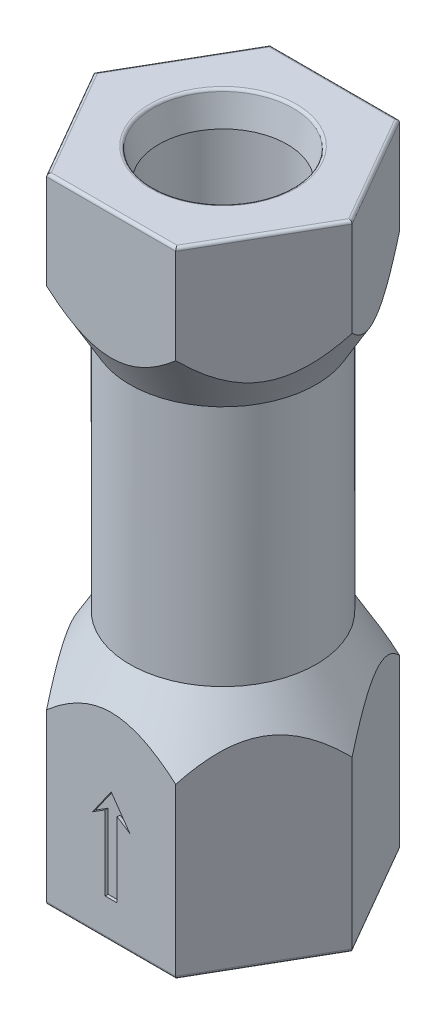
ISO-10303-21;
HEADER;
FILE_DESCRIPTION(('STEP AP214'),'2;1');
FILE_NAME('part.step','',(''),(''),'','','');
FILE_SCHEMA(('AUTOMOTIVE_DESIGN { 1 0 10303 214 1 1 1 1 }'));
ENDSEC;
DATA;
#1=APPLICATION_CONTEXT('core data for automotive mechanical design processes');
#2=APPLICATION_PROTOCOL_DEFINITION('international standard','automotive_design',2000,#1);
#3=PRODUCT_CONTEXT('',#1,'mechanical');
#4=PRODUCT('Part','Part','',(#3));
#5=PRODUCT_RELATED_PRODUCT_CATEGORY('part','',(#4));
#6=PRODUCT_DEFINITION_FORMATION('','',#4);
#7=PRODUCT_DEFINITION_CONTEXT('part definition',#1,'design');
#8=PRODUCT_DEFINITION('design','',#6,#7);
#9=PRODUCT_DEFINITION_SHAPE('','',#8);
#10=(LENGTH_UNIT() NAMED_UNIT(*) SI_UNIT(.MILLI.,.METRE.));
#11=(NAMED_UNIT(*) PLANE_ANGLE_UNIT() SI_UNIT($,.RADIAN.));
#12=(NAMED_UNIT(*) SI_UNIT($,.STERADIAN.) SOLID_ANGLE_UNIT());
#13=UNCERTAINTY_MEASURE_WITH_UNIT(LENGTH_MEASURE(1.E-05),#10,'distance_accuracy_value','');
#14=(GEOMETRIC_REPRESENTATION_CONTEXT(3) GLOBAL_UNCERTAINTY_ASSIGNED_CONTEXT((#13)) GLOBAL_UNIT_ASSIGNED_CONTEXT((#10,
#11,#12)) REPRESENTATION_CONTEXT('',''));
#15=CARTESIAN_POINT('',(0.,0.,0.));
#16=DIRECTION('',(0.,0.,1.));
#17=DIRECTION('',(1.,0.,0.));
#18=AXIS2_PLACEMENT_3D('',#15,#16,#17);
#19=CARTESIAN_POINT('',(5.4992613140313,54.0258,9.52499999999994));
#20=DIRECTION('',(-0.866025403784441,0.,-0.499999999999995));
#21=DIRECTION('',(-0.499999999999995,0.,0.866025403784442));
#22=AXIS2_PLACEMENT_3D('',#19,#20,#21);
#23=PLANE('',#22);
#24=DIRECTION('',(0.,-1.,0.));
#25=VECTOR('',#24,1.);
#26=CARTESIAN_POINT('',(10.9985226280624,54.0258,0.));
#27=LINE('',#26,#25);
#28=CARTESIAN_POINT('',(10.9985226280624,53.7464,0.));
#29=VERTEX_POINT('',#28);
#30=CARTESIAN_POINT('',(10.9985226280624,45.681496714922,0.));
#31=VERTEX_POINT('',#30);
#32=EDGE_CURVE('E654',#29,#31,#27,.T.);
#33=ORIENTED_EDGE('',*,*,#32,.F.);
#34=DIRECTION('',(-0.499999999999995,0.,0.866025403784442));
#35=VECTOR('',#34,1.);
#36=CARTESIAN_POINT('',(5.4992613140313,53.7464,9.52499999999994));
#37=LINE('',#36,#35);
#38=CARTESIAN_POINT('',(5.4992613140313,53.7464,9.52499999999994));
#39=VERTEX_POINT('',#38);
#40=EDGE_CURVE('E640',#29,#39,#37,.T.);
#41=ORIENTED_EDGE('',*,*,#40,.T.);
#42=DIRECTION('',(0.,-1.,0.));
#43=VECTOR('',#42,1.);
#44=CARTESIAN_POINT('',(5.4992613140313,54.0258,9.52499999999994));
#45=LINE('',#44,#43);
#46=CARTESIAN_POINT('',(5.4992613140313,45.681496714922,9.52499999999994));
#47=VERTEX_POINT('',#46);
#48=EDGE_CURVE('E540',#39,#47,#45,.T.);
#49=ORIENTED_EDGE('',*,*,#48,.T.);
#50=CARTESIAN_POINT('',(5.49914584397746,45.6816967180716,9.52519999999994));
#51=CARTESIAN_POINT('',(5.55666122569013,45.5820870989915,9.42558043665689));
#52=CARTESIAN_POINT('',(5.61475444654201,45.4837951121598,9.3249600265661));
#53=CARTESIAN_POINT('',(5.73221519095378,45.2902387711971,9.12151204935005));
#54=CARTESIAN_POINT('',(5.79158307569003,45.1949752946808,9.01868385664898));
#55=CARTESIAN_POINT('',(5.9119950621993,45.0074335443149,8.81012417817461));
#56=CARTESIAN_POINT('',(5.97304634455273,44.9151736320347,8.70438025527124));
#57=CARTESIAN_POINT('',(6.09662083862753,44.7347146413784,8.49034295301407));
#58=CARTESIAN_POINT('',(6.15914393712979,44.6465152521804,8.38204976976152));
#59=CARTESIAN_POINT('',(6.35236917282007,44.3844290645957,8.04737384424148));
#60=CARTESIAN_POINT('',(6.48563443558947,44.2179571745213,7.81655163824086));
#61=CARTESIAN_POINT('',(6.75936939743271,43.9115594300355,7.34242877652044));
#62=CARTESIAN_POINT('',(6.89982226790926,43.7715748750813,7.09915726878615));
#63=CARTESIAN_POINT('',(7.12243399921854,43.5824375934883,6.71358243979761));
#64=CARTESIAN_POINT('',(7.2019853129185,43.5209651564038,6.57579552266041));
#65=CARTESIAN_POINT('',(7.36317096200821,43.4099372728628,6.29661378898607));
#66=CARTESIAN_POINT('',(7.44480545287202,43.3603827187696,6.15521870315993));
#67=CARTESIAN_POINT('',(7.60917882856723,43.2750871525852,5.87051566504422));
#68=CARTESIAN_POINT('',(7.69190371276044,43.2392391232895,5.72723196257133));
#69=CARTESIAN_POINT('',(7.85860808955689,43.1820925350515,5.43849151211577));
#70=CARTESIAN_POINT('',(7.94258749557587,43.1607929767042,5.29303491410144));
#71=CARTESIAN_POINT('',(8.11194715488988,43.1334755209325,4.999695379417));
#72=CARTESIAN_POINT('',(8.19733319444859,43.1275992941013,4.85180242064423));
#73=CARTESIAN_POINT('',(8.36800537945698,43.131791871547,4.5561895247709));
#74=CARTESIAN_POINT('',(8.45329152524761,43.1418606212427,4.40846958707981));
#75=CARTESIAN_POINT('',(8.62324604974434,43.1775537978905,4.11409971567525));
#76=CARTESIAN_POINT('',(8.70791244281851,43.2032156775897,3.96745322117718));
#77=CARTESIAN_POINT('',(8.87580987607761,43.2690934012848,3.67664633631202));
#78=CARTESIAN_POINT('',(8.95904071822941,43.3093112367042,3.53248628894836));
#79=CARTESIAN_POINT('',(9.14741361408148,43.4164190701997,3.20621486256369));
#80=CARTESIAN_POINT('',(9.25193712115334,43.4876582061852,3.02517483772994));
#81=CARTESIAN_POINT('',(9.45736206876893,43.6485856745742,2.66936839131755));
#82=CARTESIAN_POINT('',(9.55826188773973,43.7382821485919,2.49460477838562));
#83=CARTESIAN_POINT('',(9.75671321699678,43.9332318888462,2.15087699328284));
#84=CARTESIAN_POINT('',(9.854249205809,44.0385477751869,1.98193970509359));
#85=CARTESIAN_POINT('',(10.0456520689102,44.2615735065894,1.65042022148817));
#86=CARTESIAN_POINT('',(10.1395195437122,44.3792813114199,1.48783698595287));
#87=CARTESIAN_POINT('',(10.3667948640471,44.6818721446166,1.09418458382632));
#88=CARTESIAN_POINT('',(10.4982799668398,44.872529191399,0.866445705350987));
#89=CARTESIAN_POINT('',(10.6900790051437,45.1693255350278,0.534240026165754));
#90=CARTESIAN_POINT('',(10.7527679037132,45.2694635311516,0.4256596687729));
#91=CARTESIAN_POINT('',(10.8767288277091,45.4731405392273,0.210953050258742));
#92=CARTESIAN_POINT('',(10.9380011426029,45.5766788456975,0.104826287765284));
#93=CARTESIAN_POINT('',(10.9986380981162,45.6816967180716,-0.000200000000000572));
#94=B_SPLINE_CURVE_WITH_KNOTS('',3,(#50,#51,#52,#53,#54,#55,#56,#57,#58,#59,#60,#61,#62,#63,#64,
#65,#66,#67,#68,#69,#70,#71,#72,#73,#74,#75,#76,#77,#78,#79,#80,#81,#82,#83,#84,#85,#86,#87,#88,
#89,#90,#91,#92,#93),.UNSPECIFIED.,.F.,.F.,(4,2,2,2,2,2,2,2,2,2,2,2,2,2,2,2,2,2,2,2,2,4),(0.,
0.456500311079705,0.913131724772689,1.37216773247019,1.83116854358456,2.77279659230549,
3.7123127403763,4.22361949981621,4.73496453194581,5.24223135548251,5.74946332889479,
6.2613384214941,6.77321176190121,7.2863194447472,7.7994973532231,8.46097120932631,
9.12273747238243,9.78723238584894,10.4516180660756,11.4251171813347,11.9064551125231,
12.387693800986),.UNSPECIFIED.);
#95=EDGE_CURVE('E464',#47,#31,#94,.T.);
#96=ORIENTED_EDGE('',*,*,#95,.T.);
#97=EDGE_LOOP('',(#33,#41,#49,#96));
#98=FACE_BOUND('',#97,.T.);
#99=ADVANCED_FACE('F46',(#98),#23,.F.);
#100=CARTESIAN_POINT('',(10.9985226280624,54.0258,0.));
#101=DIRECTION('',(-0.866025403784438,0.,0.500000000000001));
#102=DIRECTION('',(0.500000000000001,0.,0.866025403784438));
#103=AXIS2_PLACEMENT_3D('',#100,#101,#102);
#104=PLANE('',#103);
#105=DIRECTION('',(0.,-1.,0.));
#106=VECTOR('',#105,1.);
#107=CARTESIAN_POINT('',(5.49926131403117,54.0258,-9.52500000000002));
#108=LINE('',#107,#106);
#109=CARTESIAN_POINT('',(5.49926131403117,53.7464,-9.52500000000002));
#110=VERTEX_POINT('',#109);
#111=CARTESIAN_POINT('',(5.49926131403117,45.681496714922,-9.52500000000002));
#112=VERTEX_POINT('',#111);
#113=EDGE_CURVE('E705',#110,#112,#108,.T.);
#114=ORIENTED_EDGE('',*,*,#113,.F.);
#115=DIRECTION('',(0.500000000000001,0.,0.866025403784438));
#116=VECTOR('',#115,1.);
#117=CARTESIAN_POINT('',(10.9985226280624,53.7464,0.));
#118=LINE('',#117,#116);
#119=EDGE_CURVE('E626',#110,#29,#118,.T.);
#120=ORIENTED_EDGE('',*,*,#119,.T.);
#121=ORIENTED_EDGE('',*,*,#32,.T.);
#122=CARTESIAN_POINT('',(10.9986380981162,45.6816967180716,0.000200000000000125));
#123=CARTESIAN_POINT('',(10.9411227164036,45.5820870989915,-0.0994195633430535));
#124=CARTESIAN_POINT('',(10.8830294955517,45.4837951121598,-0.200039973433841));
#125=CARTESIAN_POINT('',(10.7655687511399,45.2902387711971,-0.40348795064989));
#126=CARTESIAN_POINT('',(10.7062008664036,45.1949752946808,-0.50631614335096));
#127=CARTESIAN_POINT('',(10.5857888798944,45.0074335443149,-0.71487582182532));
#128=CARTESIAN_POINT('',(10.5247375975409,44.9151736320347,-0.820619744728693));
#129=CARTESIAN_POINT('',(10.4011631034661,44.7347146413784,-1.03465704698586));
#130=CARTESIAN_POINT('',(10.3386400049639,44.6465152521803,-1.14295023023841));
#131=CARTESIAN_POINT('',(10.1454147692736,44.3844290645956,-1.47762615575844));
#132=CARTESIAN_POINT('',(10.0121495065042,44.2179571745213,-1.70844836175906));
#133=CARTESIAN_POINT('',(9.73841454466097,43.9115594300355,-2.18257122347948));
#134=CARTESIAN_POINT('',(9.59796167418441,43.7715748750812,-2.42584273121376));
#135=CARTESIAN_POINT('',(9.37534994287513,43.5824375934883,-2.8114175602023));
#136=CARTESIAN_POINT('',(9.29579862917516,43.5209651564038,-2.9492044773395));
#137=CARTESIAN_POINT('',(9.13461298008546,43.4099372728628,-3.22838621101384));
#138=CARTESIAN_POINT('',(9.05297848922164,43.3603827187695,-3.36978129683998));
#139=CARTESIAN_POINT('',(8.88860511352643,43.2750871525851,-3.65448433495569));
#140=CARTESIAN_POINT('',(8.80588022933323,43.2392391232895,-3.79776803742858));
#141=CARTESIAN_POINT('',(8.63917585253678,43.1820925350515,-4.08650848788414));
#142=CARTESIAN_POINT('',(8.55519644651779,43.1607929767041,-4.23196508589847));
#143=CARTESIAN_POINT('',(8.38583678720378,43.1334755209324,-4.5253046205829));
#144=CARTESIAN_POINT('',(8.30045074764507,43.1275992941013,-4.67319757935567));
#145=CARTESIAN_POINT('',(8.12977856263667,43.1317918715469,-4.968810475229));
#146=CARTESIAN_POINT('',(8.04449241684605,43.1418606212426,-5.11653041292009));
#147=CARTESIAN_POINT('',(7.87453789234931,43.1775537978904,-5.41090028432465));
#148=CARTESIAN_POINT('',(7.78987149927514,43.2032156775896,-5.55754677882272));
#149=CARTESIAN_POINT('',(7.62197406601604,43.2690934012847,-5.84835366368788));
#150=CARTESIAN_POINT('',(7.53874322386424,43.3093112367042,-5.99251371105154));
#151=CARTESIAN_POINT('',(7.35037032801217,43.4164190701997,-6.31878513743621));
#152=CARTESIAN_POINT('',(7.24584682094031,43.4876582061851,-6.49982516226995));
#153=CARTESIAN_POINT('',(7.04042187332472,43.6485856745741,-6.85563160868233));
#154=CARTESIAN_POINT('',(6.93952205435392,43.7382821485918,-7.03039522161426));
#155=CARTESIAN_POINT('',(6.74107072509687,43.9332318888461,-7.37412300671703));
#156=CARTESIAN_POINT('',(6.64353473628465,44.0385477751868,-7.54306029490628));
#157=CARTESIAN_POINT('',(6.45213187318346,44.2615735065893,-7.87457977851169));
#158=CARTESIAN_POINT('',(6.35826439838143,44.3792813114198,-8.03716301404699));
#159=CARTESIAN_POINT('',(6.13098907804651,44.6818721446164,-8.43081541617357));
#160=CARTESIAN_POINT('',(5.99950397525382,44.8725291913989,-8.65855429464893));
#161=CARTESIAN_POINT('',(5.80770493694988,45.1693255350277,-8.9907599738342));
#162=CARTESIAN_POINT('',(5.7450160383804,45.2694635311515,-9.09934033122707));
#163=CARTESIAN_POINT('',(5.62105511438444,45.4731405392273,-9.31404694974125));
#164=CARTESIAN_POINT('',(5.55978279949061,45.5766788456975,-9.42017371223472));
#165=CARTESIAN_POINT('',(5.49914584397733,45.6816967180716,-9.52520000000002));
#166=B_SPLINE_CURVE_WITH_KNOTS('',3,(#122,#123,#124,#125,#126,#127,#128,#129,#130,#131,#132,
#133,#134,#135,#136,#137,#138,#139,#140,#141,#142,#143,#144,#145,#146,#147,#148,#149,#150,#151,
#152,#153,#154,#155,#156,#157,#158,#159,#160,#161,#162,#163,#164,#165),.UNSPECIFIED.,.F.,.F.,(4,
2,2,2,2,2,2,2,2,2,2,2,2,2,2,2,2,2,2,2,2,4),(0.,0.456500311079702,0.913131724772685,
1.37216773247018,1.83116854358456,2.77279659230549,3.7123127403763,4.22361949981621,
4.73496453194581,5.24223135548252,5.74946332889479,6.2613384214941,6.77321176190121,
7.2863194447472,7.7994973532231,8.4609712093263,9.12273747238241,9.7872323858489,
10.4516180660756,11.4251171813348,11.9064551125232,12.3876938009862),.UNSPECIFIED.);
#167=EDGE_CURVE('E457',#31,#112,#166,.T.);
#168=ORIENTED_EDGE('',*,*,#167,.T.);
#169=EDGE_LOOP('',(#114,#120,#121,#168));
#170=FACE_BOUND('',#169,.T.);
#171=ADVANCED_FACE('F451',(#170),#104,.F.);
#172=CARTESIAN_POINT('',(5.49926131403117,54.0258,-9.52500000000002));
#173=DIRECTION('',(0.,0.,1.));
#174=DIRECTION('',(1.,0.,0.));
#175=AXIS2_PLACEMENT_3D('',#172,#173,#174);
#176=PLANE('',#175);
#177=DIRECTION('',(0.,-1.,0.));
#178=VECTOR('',#177,1.);
#179=CARTESIAN_POINT('',(-5.49926131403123,54.0258,-9.52499999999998));
#180=LINE('',#179,#178);
#181=CARTESIAN_POINT('',(-5.49926131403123,53.7464,-9.52499999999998));
#182=VERTEX_POINT('',#181);
#183=CARTESIAN_POINT('',(-5.49926131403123,45.681496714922,-9.52499999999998));
#184=VERTEX_POINT('',#183);
#185=EDGE_CURVE('E702',#182,#184,#180,.T.);
#186=ORIENTED_EDGE('',*,*,#185,.F.);
#187=DIRECTION('',(1.,0.,0.));
#188=VECTOR('',#187,1.);
#189=CARTESIAN_POINT('',(5.49926131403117,53.7464,-9.52500000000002));
#190=LINE('',#189,#188);
#191=EDGE_CURVE('E624',#182,#110,#190,.T.);
#192=ORIENTED_EDGE('',*,*,#191,.T.);
#193=ORIENTED_EDGE('',*,*,#113,.T.);
#194=CARTESIAN_POINT('',(-19.5717395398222,64.3321046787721,-9.52499999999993));
#195=CARTESIAN_POINT('',(-19.1898468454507,63.7374005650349,-9.52499999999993));
#196=CARTESIAN_POINT('',(-18.8064876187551,63.1436328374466,-9.52499999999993));
#197=CARTESIAN_POINT('',(-18.0361566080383,61.9584084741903,-9.52499999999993));
#198=CARTESIAN_POINT('',(-17.6491846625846,61.3669519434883,-9.52499999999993));
#199=CARTESIAN_POINT('',(-16.8699590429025,60.1852891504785,-9.52499999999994));
#200=CARTESIAN_POINT('',(-16.4776941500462,59.5950902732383,-9.52499999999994));
#201=CARTESIAN_POINT('',(-15.8854086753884,58.7124131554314,-9.52499999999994));
#202=CARTESIAN_POINT('',(-15.6873347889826,58.418628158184,-9.52499999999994));
#203=CARTESIAN_POINT('',(-15.2897442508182,57.8320289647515,-9.52499999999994));
#204=CARTESIAN_POINT('',(-15.0902275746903,57.5392147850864,-9.52499999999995));
#205=CARTESIAN_POINT('',(-14.447738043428,56.6017736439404,-9.52499999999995));
#206=CARTESIAN_POINT('',(-14.001684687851,55.9592518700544,-9.52499999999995));
#207=CARTESIAN_POINT('',(-13.0997307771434,54.6811557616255,-9.52499999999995));
#208=CARTESIAN_POINT('',(-12.6438305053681,54.045581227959,-9.52499999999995));
#209=CARTESIAN_POINT('',(-11.9506578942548,53.0998045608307,-9.52499999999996));
#210=CARTESIAN_POINT('',(-11.7182307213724,52.7860505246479,-9.52499999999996));
#211=CARTESIAN_POINT('',(-11.2496443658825,52.1613444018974,-9.52499999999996));
#212=CARTESIAN_POINT('',(-11.0134852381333,51.8503922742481,-9.52499999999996));
#213=CARTESIAN_POINT('',(-10.5368550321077,51.2318644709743,-9.52499999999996));
#214=CARTESIAN_POINT('',(-10.2963844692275,50.9242883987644,-9.52499999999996));
#215=CARTESIAN_POINT('',(-9.81035888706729,50.3131866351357,-9.52499999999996));
#216=CARTESIAN_POINT('',(-9.56480402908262,50.0096608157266,-9.52499999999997));
#217=CARTESIAN_POINT('',(-9.08941207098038,49.4339141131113,-9.52499999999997));
#218=CARTESIAN_POINT('',(-8.86007927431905,49.1612775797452,-9.52499999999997));
#219=CARTESIAN_POINT('',(-8.39549655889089,48.6210621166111,-9.52499999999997));
#220=CARTESIAN_POINT('',(-8.16024642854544,48.3534833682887,-9.52499999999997));
#221=CARTESIAN_POINT('',(-7.68209324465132,47.8239211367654,-9.52499999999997));
#222=CARTESIAN_POINT('',(-7.43917128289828,47.5619546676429,-9.52499999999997));
#223=CARTESIAN_POINT('',(-6.94491347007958,47.0460890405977,-9.52499999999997));
#224=CARTESIAN_POINT('',(-6.69357839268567,46.792189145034,-9.52499999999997));
#225=CARTESIAN_POINT('',(-6.18701497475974,46.3008994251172,-9.52499999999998));
#226=CARTESIAN_POINT('',(-5.93203233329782,46.0632576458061,-9.52499999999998));
#227=CARTESIAN_POINT('',(-5.41027659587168,45.6009260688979,-9.52499999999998));
#228=CARTESIAN_POINT('',(-5.14349828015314,45.3762421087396,-9.52499999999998));
#229=CARTESIAN_POINT('',(-4.59716356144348,44.9454746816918,-9.52499999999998));
#230=CARTESIAN_POINT('',(-4.31767040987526,44.7393116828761,-9.52499999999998));
#231=CARTESIAN_POINT('',(-3.74252577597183,44.351154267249,-9.52499999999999));
#232=CARTESIAN_POINT('',(-3.44689567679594,44.1691289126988,-9.52499999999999));
#233=CARTESIAN_POINT('',(-2.97993005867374,43.915761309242,-9.52499999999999));
#234=CARTESIAN_POINT('',(-2.81507894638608,43.8324497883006,-9.52499999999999));
#235=CARTESIAN_POINT('',(-2.48007430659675,43.6770535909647,-9.52499999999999));
#236=CARTESIAN_POINT('',(-2.309919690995,43.6049712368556,-9.52499999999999));
#237=CARTESIAN_POINT('',(-1.96486997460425,43.4741275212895,-9.52499999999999));
#238=CARTESIAN_POINT('',(-1.78998394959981,43.4153424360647,-9.52499999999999));
#239=CARTESIAN_POINT('',(-1.43579497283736,43.3129232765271,-9.52499999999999));
#240=CARTESIAN_POINT('',(-1.25649230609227,43.2692882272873,-9.525));
#241=CARTESIAN_POINT('',(-0.892111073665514,43.1984785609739,-9.525));
#242=CARTESIAN_POINT('',(-0.706987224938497,43.1715338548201,-9.525));
#243=CARTESIAN_POINT('',(-0.334964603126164,43.1363455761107,-9.525));
#244=CARTESIAN_POINT('',(-0.148065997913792,43.1281002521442,-9.525));
#245=CARTESIAN_POINT('',(0.225656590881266,43.1307347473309,-9.525));
#246=CARTESIAN_POINT('',(0.412480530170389,43.1416208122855,-9.525));
#247=CARTESIAN_POINT('',(0.784105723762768,43.1819678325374,-9.525));
#248=CARTESIAN_POINT('',(0.968906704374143,43.2114312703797,-9.525));
#249=CARTESIAN_POINT('',(1.34767233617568,43.2901937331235,-9.525));
#250=CARTESIAN_POINT('',(1.54137672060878,43.3407332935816,-9.52500000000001));
#251=CARTESIAN_POINT('',(1.92343355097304,43.4591388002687,-9.52500000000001));
#252=CARTESIAN_POINT('',(2.11178361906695,43.5270123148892,-9.52500000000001));
#253=CARTESIAN_POINT('',(2.48282949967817,43.6776797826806,-9.52500000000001));
#254=CARTESIAN_POINT('',(2.66551226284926,43.7605055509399,-9.52500000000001));
#255=CARTESIAN_POINT('',(3.02467960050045,43.9385496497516,-9.52500000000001));
#256=CARTESIAN_POINT('',(3.20116410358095,44.0337681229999,-9.52500000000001));
#257=CARTESIAN_POINT('',(3.5797792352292,44.2527658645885,-9.52500000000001));
#258=CARTESIAN_POINT('',(3.78072268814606,44.3785877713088,-9.52500000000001));
#259=CARTESIAN_POINT('',(4.17496948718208,44.6417351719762,-9.52500000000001));
#260=CARTESIAN_POINT('',(4.36826987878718,44.7790650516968,-9.52500000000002));
#261=CARTESIAN_POINT('',(4.74821819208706,45.0631378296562,-9.52500000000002));
#262=CARTESIAN_POINT('',(4.9348561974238,45.2098939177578,-9.52500000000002));
#263=CARTESIAN_POINT('',(5.30199522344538,45.5109008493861,-9.52500000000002));
#264=CARTESIAN_POINT('',(5.4824954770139,45.6651526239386,-9.52500000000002));
#265=CARTESIAN_POINT('',(5.84048162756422,45.9819119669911,-9.52500000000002));
#266=CARTESIAN_POINT('',(6.01789315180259,46.1445032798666,-9.52500000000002));
#267=CARTESIAN_POINT('',(6.36781397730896,46.4748711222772,-9.52500000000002));
#268=CARTESIAN_POINT('',(6.54032314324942,46.6426477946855,-9.52500000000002));
#269=CARTESIAN_POINT('',(6.88085158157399,46.9823487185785,-9.52500000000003));
#270=CARTESIAN_POINT('',(7.04887519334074,47.154268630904,-9.52500000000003));
#271=CARTESIAN_POINT('',(7.38110953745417,47.5017299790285,-9.52500000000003));
#272=CARTESIAN_POINT('',(7.54532044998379,47.6772712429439,-9.52500000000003));
#273=CARTESIAN_POINT('',(7.90904245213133,48.0735646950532,-9.52500000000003));
#274=CARTESIAN_POINT('',(8.10765821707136,48.2951380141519,-9.52500000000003));
#275=CARTESIAN_POINT('',(8.50043416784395,48.7422051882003,-9.52500000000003));
#276=CARTESIAN_POINT('',(8.69459414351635,48.9676992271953,-9.52500000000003));
#277=CARTESIAN_POINT('',(9.27135372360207,49.6491602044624,-9.52500000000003));
#278=CARTESIAN_POINT('',(9.64816381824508,50.1100296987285,-9.52500000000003));
#279=CARTESIAN_POINT('',(10.3902014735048,51.0415401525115,-9.52500000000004));
#280=CARTESIAN_POINT('',(10.7554194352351,51.5121887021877,-9.52500000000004));
#281=CARTESIAN_POINT('',(11.4764628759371,52.460540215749,-9.52500000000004));
#282=CARTESIAN_POINT('',(11.8322892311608,52.9382425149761,-9.52500000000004));
#283=CARTESIAN_POINT('',(12.5377215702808,53.900862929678,-9.52500000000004));
#284=CARTESIAN_POINT('',(12.8873003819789,54.3858009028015,-9.52500000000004));
#285=CARTESIAN_POINT('',(13.5803240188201,55.3600476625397,-9.52500000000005));
#286=CARTESIAN_POINT('',(13.9237687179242,55.8493565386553,-9.52500000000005));
#287=CARTESIAN_POINT('',(14.6054375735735,56.8312633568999,-9.52500000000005));
#288=CARTESIAN_POINT('',(14.9436640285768,57.3238597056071,-9.52500000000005));
#289=CARTESIAN_POINT('',(15.6158819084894,58.3119246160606,-9.52500000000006));
#290=CARTESIAN_POINT('',(15.9498733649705,58.8073931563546,-9.52500000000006));
#291=CARTESIAN_POINT('',(16.8602449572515,60.1684004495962,-9.52500000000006));
#292=CARTESIAN_POINT('',(17.4330160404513,61.0363529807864,-9.52500000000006));
#293=CARTESIAN_POINT('',(18.570436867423,62.7777096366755,-9.52500000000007));
#294=CARTESIAN_POINT('',(19.1350855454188,63.6511144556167,-9.52500000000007));
#295=CARTESIAN_POINT('',(20.2541467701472,65.3960617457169,-9.52500000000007));
#296=CARTESIAN_POINT('',(20.8086028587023,66.2675763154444,-9.52500000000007));
#297=CARTESIAN_POINT('',(21.6364560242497,67.5771663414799,-9.52500000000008));
#298=CARTESIAN_POINT('',(21.9117463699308,68.0140471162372,-9.52500000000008));
#299=CARTESIAN_POINT('',(22.4611862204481,68.8885239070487,-9.52500000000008));
#300=CARTESIAN_POINT('',(22.7353357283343,69.3261199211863,-9.52500000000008));
#301=CARTESIAN_POINT('',(23.0089759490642,69.7640342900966,-9.52500000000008));
#302=B_SPLINE_CURVE_WITH_KNOTS('',3,(#194,#195,#196,#197,#198,#199,#200,#201,#202,#203,#204,
#205,#206,#207,#208,#209,#210,#211,#212,#213,#214,#215,#216,#217,#218,#219,#220,#221,#222,#223,
#224,#225,#226,#227,#228,#229,#230,#231,#232,#233,#234,#235,#236,#237,#238,#239,#240,#241,#242,
#243,#244,#245,#246,#247,#248,#249,#250,#251,#252,#253,#254,#255,#256,#257,#258,#259,#260,#261,
#262,#263,#264,#265,#266,#267,#268,#269,#270,#271,#272,#273,#274,#275,#276,#277,#278,#279,#280,
#281,#282,#283,#284,#285,#286,#287,#288,#289,#290,#291,#292,#293,#294,#295,#296,#297,#298,#299,
#300,#301),.UNSPECIFIED.,.F.,.F.,(4,2,2,2,2,2,2,2,2,2,2,2,2,2,2,2,2,2,2,2,2,2,2,2,2,2,2,2,2,2,2,
2,2,2,2,2,2,2,2,2,2,2,2,2,2,2,2,2,2,2,2,2,2,4),(0.,2.12029556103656,4.24068632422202,
6.36665654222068,7.42961372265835,8.49258889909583,10.8390455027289,13.1854346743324,
14.3568117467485,15.5281716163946,16.6993923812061,17.8705760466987,18.9392992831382,
20.0080607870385,21.0797012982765,22.151243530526,23.1965693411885,24.2423624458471,
25.2834255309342,26.3231410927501,26.8769241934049,27.4308216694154,27.9837229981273,
28.5365887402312,29.0969101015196,29.6571789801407,30.2176308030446,30.7781575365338,
31.3777933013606,31.9776913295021,32.5788811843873,33.1800779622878,33.8908310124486,
34.6018561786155,35.3138989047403,36.0260302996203,36.7478459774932,37.4696815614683,
38.1907914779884,38.9118672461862,39.8044783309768,40.697131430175,42.482746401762,
44.2698032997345,46.0566928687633,47.8500492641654,49.6434424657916,51.4360217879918,
53.228587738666,56.3482425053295,59.4683029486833,62.5670912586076,64.1162336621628,
65.6653719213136),.UNSPECIFIED.);
#303=EDGE_CURVE('E465',#112,#184,#302,.F.);
#304=ORIENTED_EDGE('',*,*,#303,.T.);
#305=EDGE_LOOP('',(#186,#192,#193,#304));
#306=FACE_BOUND('',#305,.T.);
#307=ADVANCED_FACE('F514',(#306),#176,.F.);
#308=CARTESIAN_POINT('',(-5.49926131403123,54.0258,-9.52499999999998));
#309=DIRECTION('',(0.866025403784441,0.,0.499999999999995));
#310=DIRECTION('',(0.499999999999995,0.,-0.866025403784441));
#311=AXIS2_PLACEMENT_3D('',#308,#309,#310);
#312=PLANE('',#311);
#313=DIRECTION('',(0.,-1.,0.));
#314=VECTOR('',#313,1.);
#315=CARTESIAN_POINT('',(-10.9985226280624,54.0258,0.));
#316=LINE('',#315,#314);
#317=CARTESIAN_POINT('',(-10.9985226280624,53.7464,0.));
#318=VERTEX_POINT('',#317);
#319=CARTESIAN_POINT('',(-10.9985226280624,45.681496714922,0.));
#320=VERTEX_POINT('',#319);
#321=EDGE_CURVE('E699',#318,#320,#316,.T.);
#322=ORIENTED_EDGE('',*,*,#321,.F.);
#323=DIRECTION('',(0.499999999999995,0.,-0.866025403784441));
#324=VECTOR('',#323,1.);
#325=CARTESIAN_POINT('',(-5.49926131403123,53.7464,-9.52499999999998));
#326=LINE('',#325,#324);
#327=EDGE_CURVE('E622',#318,#182,#326,.T.);
#328=ORIENTED_EDGE('',*,*,#327,.T.);
#329=ORIENTED_EDGE('',*,*,#185,.T.);
#330=CARTESIAN_POINT('',(-5.49914584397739,45.6816967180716,-9.52519999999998));
#331=CARTESIAN_POINT('',(-5.55666122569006,45.5820870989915,-9.42558043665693));
#332=CARTESIAN_POINT('',(-5.61475444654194,45.4837951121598,-9.32496002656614));
#333=CARTESIAN_POINT('',(-5.73221519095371,45.2902387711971,-9.12151204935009));
#334=CARTESIAN_POINT('',(-5.79158307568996,45.1949752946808,-9.01868385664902));
#335=CARTESIAN_POINT('',(-5.91199506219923,45.0074335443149,-8.81012417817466));
#336=CARTESIAN_POINT('',(-5.97304634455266,44.9151736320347,-8.70438025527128));
#337=CARTESIAN_POINT('',(-6.09662083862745,44.7347146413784,-8.49034295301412));
#338=CARTESIAN_POINT('',(-6.15914393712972,44.6465152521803,-8.38204976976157));
#339=CARTESIAN_POINT('',(-6.35236917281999,44.3844290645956,-8.04737384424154));
#340=CARTESIAN_POINT('',(-6.48563443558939,44.2179571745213,-7.81655163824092));
#341=CARTESIAN_POINT('',(-6.75936939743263,43.9115594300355,-7.3424287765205));
#342=CARTESIAN_POINT('',(-6.89982226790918,43.7715748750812,-7.09915726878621));
#343=CARTESIAN_POINT('',(-7.12243399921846,43.5824375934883,-6.71358243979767));
#344=CARTESIAN_POINT('',(-7.20198531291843,43.5209651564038,-6.57579552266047));
#345=CARTESIAN_POINT('',(-7.36317096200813,43.4099372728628,-6.29661378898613));
#346=CARTESIAN_POINT('',(-7.44480545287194,43.3603827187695,-6.15521870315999));
#347=CARTESIAN_POINT('',(-7.60917882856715,43.2750871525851,-5.87051566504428));
#348=CARTESIAN_POINT('',(-7.69190371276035,43.2392391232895,-5.72723196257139));
#349=CARTESIAN_POINT('',(-7.8586080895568,43.1820925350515,-5.43849151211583));
#350=CARTESIAN_POINT('',(-7.94258749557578,43.1607929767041,-5.2930349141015));
#351=CARTESIAN_POINT('',(-8.1119471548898,43.1334755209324,-4.99969537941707));
#352=CARTESIAN_POINT('',(-8.19733319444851,43.1275992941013,-4.85180242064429));
#353=CARTESIAN_POINT('',(-8.3680053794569,43.1317918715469,-4.55618952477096));
#354=CARTESIAN_POINT('',(-8.45329152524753,43.1418606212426,-4.40846958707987));
#355=CARTESIAN_POINT('',(-8.62324604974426,43.1775537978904,-4.11409971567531));
#356=CARTESIAN_POINT('',(-8.70791244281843,43.2032156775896,-3.96745322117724));
#357=CARTESIAN_POINT('',(-8.87580987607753,43.2690934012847,-3.67664633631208));
#358=CARTESIAN_POINT('',(-8.95904071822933,43.3093112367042,-3.53248628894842));
#359=CARTESIAN_POINT('',(-9.1474136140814,43.4164190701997,-3.20621486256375));
#360=CARTESIAN_POINT('',(-9.25193712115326,43.4876582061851,-3.02517483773));
#361=CARTESIAN_POINT('',(-9.45736206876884,43.6485856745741,-2.66936839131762));
#362=CARTESIAN_POINT('',(-9.55826188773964,43.7382821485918,-2.49460477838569));
#363=CARTESIAN_POINT('',(-9.75671321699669,43.9332318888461,-2.15087699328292));
#364=CARTESIAN_POINT('',(-9.85424920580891,44.0385477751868,-1.98193970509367));
#365=CARTESIAN_POINT('',(-10.0456520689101,44.2615735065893,-1.65042022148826));
#366=CARTESIAN_POINT('',(-10.1395195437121,44.3792813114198,-1.48783698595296));
#367=CARTESIAN_POINT('',(-10.366794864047,44.6818721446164,-1.09418458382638));
#368=CARTESIAN_POINT('',(-10.4982799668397,44.8725291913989,-0.866445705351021));
#369=CARTESIAN_POINT('',(-10.6900790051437,45.1693255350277,-0.534240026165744));
#370=CARTESIAN_POINT('',(-10.7527679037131,45.2694635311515,-0.425659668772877));
#371=CARTESIAN_POINT('',(-10.8767288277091,45.4731405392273,-0.210953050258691));
#372=CARTESIAN_POINT('',(-10.9380011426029,45.5766788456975,-0.104826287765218));
#373=CARTESIAN_POINT('',(-10.9986380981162,45.6816967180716,0.00020000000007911));
#374=B_SPLINE_CURVE_WITH_KNOTS('',3,(#330,#331,#332,#333,#334,#335,#336,#337,#338,#339,#340,
#341,#342,#343,#344,#345,#346,#347,#348,#349,#350,#351,#352,#353,#354,#355,#356,#357,#358,#359,
#360,#361,#362,#363,#364,#365,#366,#367,#368,#369,#370,#371,#372,#373),.UNSPECIFIED.,.F.,.F.,(4,
2,2,2,2,2,2,2,2,2,2,2,2,2,2,2,2,2,2,2,2,4),(0.,0.456500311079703,0.913131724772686,
1.37216773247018,1.83116854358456,2.77279659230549,3.7123127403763,4.22361949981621,
4.73496453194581,5.24223135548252,5.74946332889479,6.2613384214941,6.77321176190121,
7.2863194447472,7.79949735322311,8.4609712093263,9.12273747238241,9.7872323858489,
10.4516180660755,11.4251171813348,11.9064551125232,12.3876938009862),.UNSPECIFIED.);
#375=EDGE_CURVE('E495',#184,#320,#374,.T.);
#376=ORIENTED_EDGE('',*,*,#375,.T.);
#377=EDGE_LOOP('',(#322,#328,#329,#376));
#378=FACE_BOUND('',#377,.T.);
#379=ADVANCED_FACE('F504',(#378),#312,.F.);
#380=CARTESIAN_POINT('',(-10.9985226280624,54.0258,0.));
#381=DIRECTION('',(0.866025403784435,0.,-0.500000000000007));
#382=DIRECTION('',(-0.500000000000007,0.,-0.866025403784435));
#383=AXIS2_PLACEMENT_3D('',#380,#381,#382);
#384=PLANE('',#383);
#385=DIRECTION('',(0.,-1.,0.));
#386=VECTOR('',#385,1.);
#387=CARTESIAN_POINT('',(-5.4992613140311,54.0258,9.52500000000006));
#388=LINE('',#387,#386);
#389=CARTESIAN_POINT('',(-5.4992613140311,53.7464,9.52500000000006));
#390=VERTEX_POINT('',#389);
#391=CARTESIAN_POINT('',(-5.49926131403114,45.681496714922,9.52500000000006));
#392=VERTEX_POINT('',#391);
#393=EDGE_CURVE('E696',#390,#392,#388,.T.);
#394=ORIENTED_EDGE('',*,*,#393,.F.);
#395=DIRECTION('',(-0.500000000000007,0.,-0.866025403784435));
#396=VECTOR('',#395,1.);
#397=CARTESIAN_POINT('',(-10.9985226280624,53.7464,0.));
#398=LINE('',#397,#396);
#399=EDGE_CURVE('E620',#390,#318,#398,.T.);
#400=ORIENTED_EDGE('',*,*,#399,.T.);
#401=ORIENTED_EDGE('',*,*,#321,.T.);
#402=CARTESIAN_POINT('',(-10.9986380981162,45.6816967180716,-0.000199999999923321));
#403=CARTESIAN_POINT('',(-10.9411227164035,45.5820870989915,0.0994195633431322));
#404=CARTESIAN_POINT('',(-10.8830294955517,45.4837951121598,0.200039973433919));
#405=CARTESIAN_POINT('',(-10.7655687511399,45.2902387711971,0.403487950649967));
#406=CARTESIAN_POINT('',(-10.7062008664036,45.1949752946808,0.506316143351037));
#407=CARTESIAN_POINT('',(-10.5857888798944,45.0074335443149,0.714875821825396));
#408=CARTESIAN_POINT('',(-10.5247375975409,44.9151736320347,0.820619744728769));
#409=CARTESIAN_POINT('',(-10.4011631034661,44.7347146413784,1.03465704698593));
#410=CARTESIAN_POINT('',(-10.3386400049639,44.6465152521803,1.14295023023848));
#411=CARTESIAN_POINT('',(-10.1454147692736,44.3844290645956,1.47762615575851));
#412=CARTESIAN_POINT('',(-10.0121495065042,44.2179571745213,1.70844836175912));
#413=CARTESIAN_POINT('',(-9.73841454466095,43.9115594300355,2.18257122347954));
#414=CARTESIAN_POINT('',(-9.5979616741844,43.7715748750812,2.42584273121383));
#415=CARTESIAN_POINT('',(-9.37534994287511,43.5824375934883,2.81141756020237));
#416=CARTESIAN_POINT('',(-9.29579862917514,43.5209651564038,2.94920447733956));
#417=CARTESIAN_POINT('',(-9.13461298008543,43.4099372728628,3.2283862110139));
#418=CARTESIAN_POINT('',(-9.05297848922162,43.3603827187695,3.36978129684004));
#419=CARTESIAN_POINT('',(-8.88860511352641,43.2750871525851,3.65448433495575));
#420=CARTESIAN_POINT('',(-8.8058802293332,43.2392391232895,3.79776803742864));
#421=CARTESIAN_POINT('',(-8.63917585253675,43.1820925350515,4.0865084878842));
#422=CARTESIAN_POINT('',(-8.55519644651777,43.1607929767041,4.23196508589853));
#423=CARTESIAN_POINT('',(-8.38583678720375,43.1334755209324,4.52530462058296));
#424=CARTESIAN_POINT('',(-8.30045074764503,43.1275992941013,4.67319757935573));
#425=CARTESIAN_POINT('',(-8.12977856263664,43.1317918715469,4.96881047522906));
#426=CARTESIAN_POINT('',(-8.04449241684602,43.1418606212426,5.11653041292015));
#427=CARTESIAN_POINT('',(-7.87453789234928,43.1775537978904,5.4109002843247));
#428=CARTESIAN_POINT('',(-7.7898714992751,43.2032156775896,5.55754677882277));
#429=CARTESIAN_POINT('',(-7.621974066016,43.2690934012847,5.84835366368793));
#430=CARTESIAN_POINT('',(-7.5387432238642,43.3093112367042,5.99251371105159));
#431=CARTESIAN_POINT('',(-7.35037032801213,43.4164190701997,6.31878513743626));
#432=CARTESIAN_POINT('',(-7.24584682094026,43.4876582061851,6.49982516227));
#433=CARTESIAN_POINT('',(-7.04042187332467,43.6485856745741,6.85563160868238));
#434=CARTESIAN_POINT('',(-6.93952205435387,43.7382821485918,7.03039522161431));
#435=CARTESIAN_POINT('',(-6.74107072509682,43.9332318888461,7.37412300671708));
#436=CARTESIAN_POINT('',(-6.6435347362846,44.0385477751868,7.54306029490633));
#437=CARTESIAN_POINT('',(-6.4521318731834,44.2615735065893,7.87457977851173));
#438=CARTESIAN_POINT('',(-6.35826439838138,44.3792813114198,8.03716301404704));
#439=CARTESIAN_POINT('',(-6.13098907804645,44.6818721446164,8.43081541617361));
#440=CARTESIAN_POINT('',(-5.99950397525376,44.8725291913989,8.65855429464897));
#441=CARTESIAN_POINT('',(-5.80770493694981,45.1693255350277,8.99075997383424));
#442=CARTESIAN_POINT('',(-5.74501603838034,45.2694635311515,9.09934033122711));
#443=CARTESIAN_POINT('',(-5.62105511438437,45.4731405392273,9.31404694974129));
#444=CARTESIAN_POINT('',(-5.55978279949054,45.5766788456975,9.42017371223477));
#445=CARTESIAN_POINT('',(-5.49914584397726,45.6816967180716,9.52520000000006));
#446=B_SPLINE_CURVE_WITH_KNOTS('',3,(#402,#403,#404,#405,#406,#407,#408,#409,#410,#411,#412,
#413,#414,#415,#416,#417,#418,#419,#420,#421,#422,#423,#424,#425,#426,#427,#428,#429,#430,#431,
#432,#433,#434,#435,#436,#437,#438,#439,#440,#441,#442,#443,#444,#445),.UNSPECIFIED.,.F.,.F.,(4,
2,2,2,2,2,2,2,2,2,2,2,2,2,2,2,2,2,2,2,2,4),(0.,0.456500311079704,0.913131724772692,
1.37216773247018,1.83116854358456,2.77279659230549,3.7123127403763,4.22361949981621,
4.73496453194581,5.24223135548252,5.74946332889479,6.2613384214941,6.77321176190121,
7.2863194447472,7.7994973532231,8.4609712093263,9.12273747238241,9.7872323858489,
10.4516180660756,11.4251171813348,11.9064551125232,12.3876938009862),.UNSPECIFIED.);
#447=EDGE_CURVE('E490',#320,#392,#446,.T.);
#448=ORIENTED_EDGE('',*,*,#447,.T.);
#449=EDGE_LOOP('',(#394,#400,#401,#448));
#450=FACE_BOUND('',#449,.T.);
#451=ADVANCED_FACE('F512',(#450),#384,.F.);
#452=CARTESIAN_POINT('',(-5.4992613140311,54.0258,9.52500000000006));
#453=DIRECTION('',(0.,0.,-1.));
#454=DIRECTION('',(-1.,0.,0.));
#455=AXIS2_PLACEMENT_3D('',#452,#453,#454);
#456=PLANE('',#455);
#457=ORIENTED_EDGE('',*,*,#48,.F.);
#458=DIRECTION('',(-1.,0.,0.));
#459=VECTOR('',#458,1.);
#460=CARTESIAN_POINT('',(-5.4992613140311,53.7464,9.52500000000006));
#461=LINE('',#460,#459);
#462=EDGE_CURVE('E618',#39,#390,#461,.T.);
#463=ORIENTED_EDGE('',*,*,#462,.T.);
#464=ORIENTED_EDGE('',*,*,#393,.T.);
#465=CARTESIAN_POINT('',(-19.5717395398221,64.3321046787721,9.5250000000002));
#466=CARTESIAN_POINT('',(-19.1898468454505,63.7374005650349,9.5250000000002));
#467=CARTESIAN_POINT('',(-18.806487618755,63.1436328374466,9.5250000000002));
#468=CARTESIAN_POINT('',(-18.0361566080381,61.9584084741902,9.52500000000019));
#469=CARTESIAN_POINT('',(-17.6491846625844,61.3669519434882,9.52500000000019));
#470=CARTESIAN_POINT('',(-16.8699590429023,60.1852891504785,9.52500000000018));
#471=CARTESIAN_POINT('',(-16.477694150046,59.5950902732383,9.52500000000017));
#472=CARTESIAN_POINT('',(-15.8854086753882,58.7124131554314,9.52500000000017));
#473=CARTESIAN_POINT('',(-15.6873347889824,58.418628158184,9.52500000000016));
#474=CARTESIAN_POINT('',(-15.2897442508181,57.8320289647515,9.52500000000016));
#475=CARTESIAN_POINT('',(-15.0902275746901,57.5392147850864,9.52500000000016));
#476=CARTESIAN_POINT('',(-14.4477380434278,56.6017736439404,9.52500000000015));
#477=CARTESIAN_POINT('',(-14.0016846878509,55.9592518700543,9.52500000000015));
#478=CARTESIAN_POINT('',(-13.0997307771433,54.6811557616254,9.52500000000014));
#479=CARTESIAN_POINT('',(-12.6438305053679,54.045581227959,9.52500000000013));
#480=CARTESIAN_POINT('',(-11.9506578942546,53.0998045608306,9.52500000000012));
#481=CARTESIAN_POINT('',(-11.7182307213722,52.7860505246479,9.52500000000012));
#482=CARTESIAN_POINT('',(-11.2496443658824,52.1613444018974,9.52500000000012));
#483=CARTESIAN_POINT('',(-11.0134852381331,51.8503922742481,9.52500000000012));
#484=CARTESIAN_POINT('',(-10.5368550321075,51.2318644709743,9.52500000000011));
#485=CARTESIAN_POINT('',(-10.2963844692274,50.9242883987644,9.52500000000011));
#486=CARTESIAN_POINT('',(-9.81035888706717,50.3131866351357,9.5250000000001));
#487=CARTESIAN_POINT('',(-9.5648040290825,50.0096608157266,9.5250000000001));
#488=CARTESIAN_POINT('',(-9.08941207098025,49.4339141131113,9.5250000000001));
#489=CARTESIAN_POINT('',(-8.86007927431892,49.1612775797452,9.52500000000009));
#490=CARTESIAN_POINT('',(-8.39549655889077,48.6210621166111,9.52500000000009));
#491=CARTESIAN_POINT('',(-8.16024642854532,48.3534833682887,9.52500000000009));
#492=CARTESIAN_POINT('',(-7.68209324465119,47.8239211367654,9.52500000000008));
#493=CARTESIAN_POINT('',(-7.43917128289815,47.5619546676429,9.52500000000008));
#494=CARTESIAN_POINT('',(-6.94491347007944,47.0460890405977,9.52500000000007));
#495=CARTESIAN_POINT('',(-6.69357839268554,46.792189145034,9.52500000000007));
#496=CARTESIAN_POINT('',(-6.18701497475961,46.3008994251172,9.52500000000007));
#497=CARTESIAN_POINT('',(-5.93203233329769,46.0632576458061,9.52500000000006));
#498=CARTESIAN_POINT('',(-5.41027659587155,45.6009260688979,9.52500000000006));
#499=CARTESIAN_POINT('',(-5.143498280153,45.3762421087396,9.52500000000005));
#500=CARTESIAN_POINT('',(-4.59716356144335,44.9454746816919,9.52500000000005));
#501=CARTESIAN_POINT('',(-4.31767040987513,44.7393116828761,9.52500000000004));
#502=CARTESIAN_POINT('',(-3.7425257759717,44.351154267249,9.52500000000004));
#503=CARTESIAN_POINT('',(-3.44689567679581,44.1691289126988,9.52500000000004));
#504=CARTESIAN_POINT('',(-2.97993005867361,43.915761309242,9.52500000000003));
#505=CARTESIAN_POINT('',(-2.81507894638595,43.8324497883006,9.52500000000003));
#506=CARTESIAN_POINT('',(-2.48007430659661,43.6770535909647,9.52500000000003));
#507=CARTESIAN_POINT('',(-2.30991969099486,43.6049712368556,9.52500000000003));
#508=CARTESIAN_POINT('',(-1.96486997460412,43.4741275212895,9.52500000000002));
#509=CARTESIAN_POINT('',(-1.78998394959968,43.4153424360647,9.52500000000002));
#510=CARTESIAN_POINT('',(-1.43579497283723,43.3129232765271,9.52500000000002));
#511=CARTESIAN_POINT('',(-1.25649230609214,43.2692882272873,9.52500000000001));
#512=CARTESIAN_POINT('',(-0.892111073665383,43.1984785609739,9.52500000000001));
#513=CARTESIAN_POINT('',(-0.706987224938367,43.1715338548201,9.52500000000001));
#514=CARTESIAN_POINT('',(-0.334964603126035,43.1363455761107,9.525));
#515=CARTESIAN_POINT('',(-0.148065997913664,43.1281002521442,9.525));
#516=CARTESIAN_POINT('',(0.225656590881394,43.1307347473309,9.525));
#517=CARTESIAN_POINT('',(0.412480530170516,43.1416208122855,9.525));
#518=CARTESIAN_POINT('',(0.784105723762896,43.1819678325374,9.52499999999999));
#519=CARTESIAN_POINT('',(0.968906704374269,43.2114312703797,9.52499999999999));
#520=CARTESIAN_POINT('',(1.3476723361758,43.2901937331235,9.52499999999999));
#521=CARTESIAN_POINT('',(1.5413767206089,43.3407332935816,9.52499999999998));
#522=CARTESIAN_POINT('',(1.92343355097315,43.4591388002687,9.52499999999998));
#523=CARTESIAN_POINT('',(2.11178361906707,43.5270123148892,9.52499999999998));
#524=CARTESIAN_POINT('',(2.48282949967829,43.6776797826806,9.52499999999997));
#525=CARTESIAN_POINT('',(2.66551226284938,43.7605055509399,9.52499999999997));
#526=CARTESIAN_POINT('',(3.02467960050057,43.9385496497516,9.52499999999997));
#527=CARTESIAN_POINT('',(3.20116410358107,44.0337681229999,9.52499999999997));
#528=CARTESIAN_POINT('',(3.57977923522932,44.2527658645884,9.52499999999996));
#529=CARTESIAN_POINT('',(3.78072268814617,44.3785877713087,9.52499999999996));
#530=CARTESIAN_POINT('',(4.17496948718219,44.6417351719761,9.52499999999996));
#531=CARTESIAN_POINT('',(4.36826987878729,44.7790650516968,9.52499999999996));
#532=CARTESIAN_POINT('',(4.74821819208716,45.0631378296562,9.52499999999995));
#533=CARTESIAN_POINT('',(4.93485619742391,45.2098939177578,9.52499999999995));
#534=CARTESIAN_POINT('',(5.30199522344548,45.5109008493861,9.52499999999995));
#535=CARTESIAN_POINT('',(5.48249547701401,45.6651526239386,9.52499999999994));
#536=CARTESIAN_POINT('',(5.84048162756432,45.981911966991,9.52499999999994));
#537=CARTESIAN_POINT('',(6.0178931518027,46.1445032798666,9.52499999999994));
#538=CARTESIAN_POINT('',(6.36781397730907,46.4748711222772,9.52499999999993));
#539=CARTESIAN_POINT('',(6.54032314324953,46.6426477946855,9.52499999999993));
#540=CARTESIAN_POINT('',(6.8808515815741,46.9823487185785,9.52499999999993));
#541=CARTESIAN_POINT('',(7.04887519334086,47.154268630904,9.52499999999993));
#542=CARTESIAN_POINT('',(7.38110953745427,47.5017299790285,9.52499999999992));
#543=CARTESIAN_POINT('',(7.5453204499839,47.6772712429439,9.52499999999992));
#544=CARTESIAN_POINT('',(7.90904245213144,48.0735646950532,9.52499999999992));
#545=CARTESIAN_POINT('',(8.10765821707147,48.2951380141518,9.52499999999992));
#546=CARTESIAN_POINT('',(8.50043416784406,48.7422051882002,9.52499999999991));
#547=CARTESIAN_POINT('',(8.69459414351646,48.9676992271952,9.52499999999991));
#548=CARTESIAN_POINT('',(9.27135372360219,49.6491602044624,9.5249999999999));
#549=CARTESIAN_POINT('',(9.64816381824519,50.1100296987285,9.5249999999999));
#550=CARTESIAN_POINT('',(10.3902014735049,51.0415401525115,9.52499999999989));
#551=CARTESIAN_POINT('',(10.7554194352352,51.5121887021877,9.52499999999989));
#552=CARTESIAN_POINT('',(11.4764628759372,52.460540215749,9.52499999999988));
#553=CARTESIAN_POINT('',(11.8322892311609,52.9382425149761,9.52499999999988));
#554=CARTESIAN_POINT('',(12.537721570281,53.900862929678,9.52499999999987));
#555=CARTESIAN_POINT('',(12.887300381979,54.3858009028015,9.52499999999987));
#556=CARTESIAN_POINT('',(13.5803240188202,55.3600476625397,9.52499999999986));
#557=CARTESIAN_POINT('',(13.9237687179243,55.8493565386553,9.52499999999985));
#558=CARTESIAN_POINT('',(14.6054375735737,56.8312633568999,9.52499999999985));
#559=CARTESIAN_POINT('',(14.943664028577,57.3238597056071,9.52499999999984));
#560=CARTESIAN_POINT('',(15.6158819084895,58.3119246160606,9.52499999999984));
#561=CARTESIAN_POINT('',(15.9498733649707,58.8073931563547,9.52499999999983));
#562=CARTESIAN_POINT('',(16.8602449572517,60.1684004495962,9.52499999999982));
#563=CARTESIAN_POINT('',(17.4330160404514,61.0363529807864,9.52499999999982));
#564=CARTESIAN_POINT('',(18.5704368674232,62.7777096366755,9.52499999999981));
#565=CARTESIAN_POINT('',(19.1350855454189,63.6511144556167,9.5249999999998));
#566=CARTESIAN_POINT('',(20.2541467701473,65.3960617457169,9.52499999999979));
#567=CARTESIAN_POINT('',(20.8086028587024,66.2675763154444,9.52499999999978));
#568=CARTESIAN_POINT('',(21.6364560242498,67.5771663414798,9.52499999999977));
#569=CARTESIAN_POINT('',(21.911746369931,68.0140471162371,9.52499999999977));
#570=CARTESIAN_POINT('',(22.4611862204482,68.8885239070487,9.52499999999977));
#571=CARTESIAN_POINT('',(22.7353357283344,69.3261199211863,9.52499999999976));
#572=CARTESIAN_POINT('',(23.0089759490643,69.7640342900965,9.52499999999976));
#573=B_SPLINE_CURVE_WITH_KNOTS('',3,(#465,#466,#467,#468,#469,#470,#471,#472,#473,#474,#475,
#476,#477,#478,#479,#480,#481,#482,#483,#484,#485,#486,#487,#488,#489,#490,#491,#492,#493,#494,
#495,#496,#497,#498,#499,#500,#501,#502,#503,#504,#505,#506,#507,#508,#509,#510,#511,#512,#513,
#514,#515,#516,#517,#518,#519,#520,#521,#522,#523,#524,#525,#526,#527,#528,#529,#530,#531,#532,
#533,#534,#535,#536,#537,#538,#539,#540,#541,#542,#543,#544,#545,#546,#547,#548,#549,#550,#551,
#552,#553,#554,#555,#556,#557,#558,#559,#560,#561,#562,#563,#564,#565,#566,#567,#568,#569,#570,
#571,#572),.UNSPECIFIED.,.F.,.F.,(4,2,2,2,2,2,2,2,2,2,2,2,2,2,2,2,2,2,2,2,2,2,2,2,2,2,2,2,2,2,2,
2,2,2,2,2,2,2,2,2,2,2,2,2,2,2,2,2,2,2,2,2,2,4),(0.,2.12029556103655,4.240686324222,
6.36665654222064,7.42961372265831,8.49258889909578,10.8390455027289,13.1854346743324,
14.3568117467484,15.5281716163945,16.699392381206,17.8705760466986,18.9392992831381,
20.0080607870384,21.0797012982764,22.1512435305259,23.1965693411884,24.242362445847,
25.2834255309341,26.32314109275,26.8769241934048,27.4308216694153,27.9837229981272,
28.5365887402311,29.0969101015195,29.6571789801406,30.2176308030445,30.7781575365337,
31.3777933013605,31.977691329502,32.5788811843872,33.1800779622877,33.8908310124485,
34.6018561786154,35.3138989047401,36.0260302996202,36.7478459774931,37.4696815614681,
38.1907914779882,38.9118672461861,39.8044783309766,40.6971314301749,42.4827464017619,
44.2698032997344,46.0566928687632,47.8500492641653,49.6434424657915,51.4360217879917,
53.2285877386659,56.3482425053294,59.4683029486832,62.5670912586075,64.1162336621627,
65.6653719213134),.UNSPECIFIED.);
#574=EDGE_CURVE('E483',#392,#47,#573,.T.);
#575=ORIENTED_EDGE('',*,*,#574,.T.);
#576=EDGE_LOOP('',(#457,#463,#464,#575));
#577=FACE_BOUND('',#576,.T.);
#578=ADVANCED_FACE('F525',(#577),#456,.F.);
#579=CARTESIAN_POINT('',(5.49926131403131,14.440303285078,9.52499999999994));
#580=VERTEX_POINT('',#579);
#581=CARTESIAN_POINT('',(5.4992613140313,0.279400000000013,9.52499999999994));
#582=VERTEX_POINT('',#581);
#583=EDGE_CURVE('E534',#580,#582,#45,.T.);
#584=ORIENTED_EDGE('',*,*,#583,.T.);
#585=DIRECTION('',(0.499999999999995,0.,-0.866025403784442));
#586=VECTOR('',#585,1.);
#587=CARTESIAN_POINT('',(5.4992613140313,0.279399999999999,9.52499999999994));
#588=LINE('',#587,#586);
#589=CARTESIAN_POINT('',(10.9985226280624,0.279400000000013,0.));
#590=VERTEX_POINT('',#589);
#591=EDGE_CURVE('E537',#582,#590,#588,.T.);
#592=ORIENTED_EDGE('',*,*,#591,.T.);
#593=CARTESIAN_POINT('',(10.9985226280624,14.440303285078,0.));
#594=VERTEX_POINT('',#593);
#595=EDGE_CURVE('E706',#594,#590,#27,.T.);
#596=ORIENTED_EDGE('',*,*,#595,.F.);
#597=CARTESIAN_POINT('',(10.9986380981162,14.4401032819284,-0.0002));
#598=CARTESIAN_POINT('',(10.9411227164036,14.5397129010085,0.0994195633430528));
#599=CARTESIAN_POINT('',(10.8830294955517,14.6380048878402,0.200039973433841));
#600=CARTESIAN_POINT('',(10.7655687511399,14.8315612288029,0.403487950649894));
#601=CARTESIAN_POINT('',(10.7062008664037,14.9268247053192,0.506316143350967));
#602=CARTESIAN_POINT('',(10.5857888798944,15.1143664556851,0.714875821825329));
#603=CARTESIAN_POINT('',(10.5247375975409,15.2066263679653,0.820619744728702));
#604=CARTESIAN_POINT('',(10.4011631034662,15.3870853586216,1.03465704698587));
#605=CARTESIAN_POINT('',(10.3386400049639,15.4752847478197,1.14295023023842));
#606=CARTESIAN_POINT('',(10.1454147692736,15.7373709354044,1.47762615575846));
#607=CARTESIAN_POINT('',(10.0121495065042,15.9038428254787,1.70844836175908));
#608=CARTESIAN_POINT('',(9.73841454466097,16.2102405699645,2.1825712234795));
#609=CARTESIAN_POINT('',(9.59796167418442,16.3502251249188,2.42584273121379));
#610=CARTESIAN_POINT('',(9.37534994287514,16.5393624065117,2.81141756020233));
#611=CARTESIAN_POINT('',(9.29579862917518,16.6008348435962,2.94920447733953));
#612=CARTESIAN_POINT('',(9.13461298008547,16.7118627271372,3.22838621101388));
#613=CARTESIAN_POINT('',(9.05297848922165,16.7614172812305,3.36978129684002));
#614=CARTESIAN_POINT('',(8.88860511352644,16.8467128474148,3.65448433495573));
#615=CARTESIAN_POINT('',(8.80588022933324,16.8825608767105,3.79776803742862));
#616=CARTESIAN_POINT('',(8.63917585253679,16.9397074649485,4.08650848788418));
#617=CARTESIAN_POINT('',(8.55519644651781,16.9610070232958,4.23196508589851));
#618=CARTESIAN_POINT('',(8.38583678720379,16.9883244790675,4.52530462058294));
#619=CARTESIAN_POINT('',(8.30045074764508,16.9942007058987,4.67319757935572));
#620=CARTESIAN_POINT('',(8.12977856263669,16.990008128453,4.96881047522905));
#621=CARTESIAN_POINT('',(8.04449241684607,16.9799393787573,5.11653041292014));
#622=CARTESIAN_POINT('',(7.87453789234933,16.9442462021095,5.4109002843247));
#623=CARTESIAN_POINT('',(7.78987149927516,16.9185843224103,5.55754677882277));
#624=CARTESIAN_POINT('',(7.62197406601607,16.8527065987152,5.84835366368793));
#625=CARTESIAN_POINT('',(7.53874322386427,16.8124887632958,5.99251371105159));
#626=CARTESIAN_POINT('',(7.3503703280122,16.7053809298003,6.31878513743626));
#627=CARTESIAN_POINT('',(7.24584682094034,16.6341417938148,6.49982516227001));
#628=CARTESIAN_POINT('',(7.04042187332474,16.4732143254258,6.8556316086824));
#629=CARTESIAN_POINT('',(6.93952205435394,16.3835178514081,7.03039522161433));
#630=CARTESIAN_POINT('',(6.7410707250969,16.1885681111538,7.37412300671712));
#631=CARTESIAN_POINT('',(6.64353473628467,16.0832522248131,7.54306029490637));
#632=CARTESIAN_POINT('',(6.45213187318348,15.8602264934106,7.87457977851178));
#633=CARTESIAN_POINT('',(6.35826439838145,15.7425186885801,8.03716301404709));
#634=CARTESIAN_POINT('',(6.13098907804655,15.4399278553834,8.43081541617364));
#635=CARTESIAN_POINT('',(5.99950397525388,15.249270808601,8.65855429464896));
#636=CARTESIAN_POINT('',(5.80770493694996,14.9524744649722,8.99075997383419));
#637=CARTESIAN_POINT('',(5.7450160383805,14.8523364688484,9.09934033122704));
#638=CARTESIAN_POINT('',(5.62105511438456,14.6486594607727,9.3140469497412));
#639=CARTESIAN_POINT('',(5.55978279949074,14.5451211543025,9.42017371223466));
#640=CARTESIAN_POINT('',(5.49914584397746,14.4401032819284,9.52519999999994));
#641=B_SPLINE_CURVE_WITH_KNOTS('',3,(#597,#598,#599,#600,#601,#602,#603,#604,#605,#606,#607,
#608,#609,#610,#611,#612,#613,#614,#615,#616,#617,#618,#619,#620,#621,#622,#623,#624,#625,#626,
#627,#628,#629,#630,#631,#632,#633,#634,#635,#636,#637,#638,#639,#640),.UNSPECIFIED.,.F.,.F.,(4,
2,2,2,2,2,2,2,2,2,2,2,2,2,2,2,2,2,2,2,2,4),(0.,0.4565003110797,0.913131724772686,
1.37216773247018,1.83116854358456,2.77279659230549,3.7123127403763,4.22361949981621,
4.73496453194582,5.24223135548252,5.7494633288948,6.2613384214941,6.77321176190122,
7.28631944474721,7.79949735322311,8.46097120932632,9.12273747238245,9.78723238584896,
10.4516180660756,11.4251171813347,11.9064551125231,12.387693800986),.UNSPECIFIED.);
#642=EDGE_CURVE('E440',#594,#580,#641,.T.);
#643=ORIENTED_EDGE('',*,*,#642,.T.);
#644=EDGE_LOOP('',(#584,#592,#596,#643));
#645=FACE_BOUND('',#644,.T.);
#646=ADVANCED_FACE('F450',(#645),#23,.F.);
#647=ORIENTED_EDGE('',*,*,#595,.T.);
#648=DIRECTION('',(-0.500000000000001,0.,-0.866025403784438));
#649=VECTOR('',#648,1.);
#650=CARTESIAN_POINT('',(10.9985226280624,0.279399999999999,0.));
#651=LINE('',#650,#649);
#652=CARTESIAN_POINT('',(5.49926131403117,0.279400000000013,-9.52500000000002));
#653=VERTEX_POINT('',#652);
#654=EDGE_CURVE('E70',#590,#653,#651,.T.);
#655=ORIENTED_EDGE('',*,*,#654,.T.);
#656=CARTESIAN_POINT('',(5.49926131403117,14.440303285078,-9.52500000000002));
#657=VERTEX_POINT('',#656);
#658=EDGE_CURVE('E704',#657,#653,#108,.T.);
#659=ORIENTED_EDGE('',*,*,#658,.F.);
#660=CARTESIAN_POINT('',(5.49914584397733,14.4401032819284,-9.52520000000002));
#661=CARTESIAN_POINT('',(5.55666122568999,14.5397129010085,-9.42558043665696));
#662=CARTESIAN_POINT('',(5.61475444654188,14.6380048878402,-9.32496002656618));
#663=CARTESIAN_POINT('',(5.73221519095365,14.8315612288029,-9.12151204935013));
#664=CARTESIAN_POINT('',(5.7915830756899,14.9268247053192,-9.01868385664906));
#665=CARTESIAN_POINT('',(5.91199506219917,15.1143664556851,-8.8101241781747));
#666=CARTESIAN_POINT('',(5.9730463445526,15.2066263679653,-8.70438025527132));
#667=CARTESIAN_POINT('',(6.0966208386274,15.3870853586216,-8.49034295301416));
#668=CARTESIAN_POINT('',(6.15914393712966,15.4752847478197,-8.38204976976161));
#669=CARTESIAN_POINT('',(6.35236917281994,15.7373709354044,-8.04737384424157));
#670=CARTESIAN_POINT('',(6.48563443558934,15.9038428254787,-7.81655163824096));
#671=CARTESIAN_POINT('',(6.75936939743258,16.2102405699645,-7.34242877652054));
#672=CARTESIAN_POINT('',(6.89982226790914,16.3502251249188,-7.09915726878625));
#673=CARTESIAN_POINT('',(7.12243399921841,16.5393624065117,-6.71358243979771));
#674=CARTESIAN_POINT('',(7.20198531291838,16.6008348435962,-6.57579552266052));
#675=CARTESIAN_POINT('',(7.36317096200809,16.7118627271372,-6.29661378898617));
#676=CARTESIAN_POINT('',(7.4448054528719,16.7614172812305,-6.15521870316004));
#677=CARTESIAN_POINT('',(7.60917882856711,16.8467128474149,-5.87051566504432));
#678=CARTESIAN_POINT('',(7.69190371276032,16.8825608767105,-5.72723196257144));
#679=CARTESIAN_POINT('',(7.85860808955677,16.9397074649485,-5.43849151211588));
#680=CARTESIAN_POINT('',(7.94258749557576,16.9610070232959,-5.29303491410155));
#681=CARTESIAN_POINT('',(8.11194715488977,16.9883244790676,-4.99969537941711));
#682=CARTESIAN_POINT('',(8.19733319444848,16.9942007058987,-4.85180242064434));
#683=CARTESIAN_POINT('',(8.36800537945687,16.9900081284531,-4.55618952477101));
#684=CARTESIAN_POINT('',(8.4532915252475,16.9799393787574,-4.40846958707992));
#685=CARTESIAN_POINT('',(8.62324604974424,16.9442462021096,-4.11409971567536));
#686=CARTESIAN_POINT('',(8.70791244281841,16.9185843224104,-3.96745322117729));
#687=CARTESIAN_POINT('',(8.87580987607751,16.8527065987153,-3.67664633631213));
#688=CARTESIAN_POINT('',(8.95904071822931,16.8124887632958,-3.53248628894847));
#689=CARTESIAN_POINT('',(9.14741361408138,16.7053809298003,-3.2062148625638));
#690=CARTESIAN_POINT('',(9.25193712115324,16.6341417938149,-3.02517483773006));
#691=CARTESIAN_POINT('',(9.45736206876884,16.4732143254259,-2.66936839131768));
#692=CARTESIAN_POINT('',(9.55826188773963,16.3835178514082,-2.49460477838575));
#693=CARTESIAN_POINT('',(9.75671321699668,16.1885681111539,-2.15087699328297));
#694=CARTESIAN_POINT('',(9.85424920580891,16.0832522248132,-1.98193970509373));
#695=CARTESIAN_POINT('',(10.0456520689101,15.8602264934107,-1.65042022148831));
#696=CARTESIAN_POINT('',(10.1395195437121,15.7425186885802,-1.48783698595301));
#697=CARTESIAN_POINT('',(10.366794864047,15.4399278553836,-1.09418458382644));
#698=CARTESIAN_POINT('',(10.4982799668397,15.2492708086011,-0.866445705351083));
#699=CARTESIAN_POINT('',(10.6900790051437,14.9524744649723,-0.534240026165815));
#700=CARTESIAN_POINT('',(10.7527679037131,14.8523364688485,-0.42565966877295));
#701=CARTESIAN_POINT('',(10.8767288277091,14.6486594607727,-0.210953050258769));
#702=CARTESIAN_POINT('',(10.9380011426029,14.5451211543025,-0.104826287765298));
#703=CARTESIAN_POINT('',(10.9986380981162,14.4401032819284,0.000199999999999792));
#704=B_SPLINE_CURVE_WITH_KNOTS('',3,(#660,#661,#662,#663,#664,#665,#666,#667,#668,#669,#670,
#671,#672,#673,#674,#675,#676,#677,#678,#679,#680,#681,#682,#683,#684,#685,#686,#687,#688,#689,
#690,#691,#692,#693,#694,#695,#696,#697,#698,#699,#700,#701,#702,#703),.UNSPECIFIED.,.F.,.F.,(4,
2,2,2,2,2,2,2,2,2,2,2,2,2,2,2,2,2,2,2,2,4),(0.,0.456500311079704,0.913131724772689,
1.37216773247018,1.83116854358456,2.77279659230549,3.7123127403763,4.22361949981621,
4.73496453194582,5.24223135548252,5.7494633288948,6.2613384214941,6.77321176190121,
7.28631944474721,7.79949735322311,8.46097120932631,9.12273747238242,9.78723238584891,
10.4516180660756,11.4251171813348,11.9064551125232,12.3876938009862),.UNSPECIFIED.);
#705=EDGE_CURVE('E434',#657,#594,#704,.T.);
#706=ORIENTED_EDGE('',*,*,#705,.T.);
#707=EDGE_LOOP('',(#647,#655,#659,#706));
#708=FACE_BOUND('',#707,.T.);
#709=ADVANCED_FACE('F446',(#708),#104,.F.);
#710=DIRECTION('',(0.,1.,0.));
#711=VECTOR('',#710,1.);
#712=CARTESIAN_POINT('',(-0.508000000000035,3.2004,-9.525));
#713=LINE('',#712,#711);
#714=CARTESIAN_POINT('',(-0.508000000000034,3.20040000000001,-9.525));
#715=VERTEX_POINT('',#714);
#716=CARTESIAN_POINT('',(-0.508000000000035,9.5504,-9.525));
#717=VERTEX_POINT('',#716);
#718=EDGE_CURVE('E300',#715,#717,#713,.T.);
#719=ORIENTED_EDGE('',*,*,#718,.F.);
#720=DIRECTION('',(-1.,0.,0.));
#721=VECTOR('',#720,1.);
#722=CARTESIAN_POINT('',(0.507999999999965,3.2004,-9.525));
#723=LINE('',#722,#721);
#724=CARTESIAN_POINT('',(0.507999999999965,3.2004,-9.525));
#725=VERTEX_POINT('',#724);
#726=EDGE_CURVE('E265',#725,#715,#723,.T.);
#727=ORIENTED_EDGE('',*,*,#726,.F.);
#728=DIRECTION('',(0.,-1.,0.));
#729=VECTOR('',#728,1.);
#730=CARTESIAN_POINT('',(0.507999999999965,3.2004,-9.525));
#731=LINE('',#730,#729);
#732=CARTESIAN_POINT('',(0.507999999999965,9.5504,-9.525));
#733=VERTEX_POINT('',#732);
#734=EDGE_CURVE('E283',#733,#725,#731,.T.);
#735=ORIENTED_EDGE('',*,*,#734,.F.);
#736=DIRECTION('',(-0.8462329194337,0.532813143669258,0.));
#737=VECTOR('',#736,1.);
#738=CARTESIAN_POINT('',(0.507999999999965,9.5504,-9.525));
#739=LINE('',#738,#737);
#740=CARTESIAN_POINT('',(1.58749999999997,8.8707150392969,-9.52500000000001));
#741=VERTEX_POINT('',#740);
#742=EDGE_CURVE('E286',#741,#733,#739,.T.);
#743=ORIENTED_EDGE('',*,*,#742,.F.);
#744=DIRECTION('',(0.573576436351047,-0.819152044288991,0.));
#745=VECTOR('',#744,1.);
#746=CARTESIAN_POINT('',(1.58749999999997,8.8707150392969,-9.52500000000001));
#747=LINE('',#746,#745);
#748=CARTESIAN_POINT('',(0.,11.1379,-9.525));
#749=VERTEX_POINT('',#748);
#750=EDGE_CURVE('E309',#749,#741,#747,.T.);
#751=ORIENTED_EDGE('',*,*,#750,.F.);
#752=DIRECTION('',(0.573576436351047,0.819152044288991,0.));
#753=VECTOR('',#752,1.);
#754=CARTESIAN_POINT('',(-1.58750000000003,8.8707150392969,-9.525));
#755=LINE('',#754,#753);
#756=CARTESIAN_POINT('',(-1.58750000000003,8.8707150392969,-9.525));
#757=VERTEX_POINT('',#756);
#758=EDGE_CURVE('E306',#757,#749,#755,.T.);
#759=ORIENTED_EDGE('',*,*,#758,.F.);
#760=DIRECTION('',(-0.8462329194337,-0.532813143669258,0.));
#761=VECTOR('',#760,1.);
#762=CARTESIAN_POINT('',(-0.508000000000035,9.5504,-9.525));
#763=LINE('',#762,#761);
#764=EDGE_CURVE('E303',#717,#757,#763,.T.);
#765=ORIENTED_EDGE('',*,*,#764,.F.);
#766=EDGE_LOOP('',(#719,#727,#735,#743,#751,#759,#765));
#767=FACE_BOUND('',#766,.T.);
#768=ORIENTED_EDGE('',*,*,#658,.T.);
#769=DIRECTION('',(-1.,0.,0.));
#770=VECTOR('',#769,1.);
#771=CARTESIAN_POINT('',(5.49926131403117,0.279399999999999,-9.52500000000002));
#772=LINE('',#771,#770);
#773=CARTESIAN_POINT('',(-5.49926131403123,0.279400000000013,-9.52499999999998));
#774=VERTEX_POINT('',#773);
#775=EDGE_CURVE('E55',#653,#774,#772,.T.);
#776=ORIENTED_EDGE('',*,*,#775,.T.);
#777=CARTESIAN_POINT('',(-5.49926131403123,14.440303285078,-9.52499999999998));
#778=VERTEX_POINT('',#777);
#779=EDGE_CURVE('E701',#778,#774,#180,.T.);
#780=ORIENTED_EDGE('',*,*,#779,.F.);
#781=CARTESIAN_POINT('',(-12.8249964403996,5.82049164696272,-9.52499999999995));
#782=CARTESIAN_POINT('',(-12.5554964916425,6.19515615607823,-9.52499999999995));
#783=CARTESIAN_POINT('',(-12.284067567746,6.56845105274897,-9.52499999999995));
#784=CARTESIAN_POINT('',(-11.7364527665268,7.31164995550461,-9.52499999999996));
#785=CARTESIAN_POINT('',(-11.4602659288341,7.68155325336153,-9.52499999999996));
#786=CARTESIAN_POINT('',(-10.8999075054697,8.42037837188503,-9.52499999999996));
#787=CARTESIAN_POINT('',(-10.6156872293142,8.78926335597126,-9.52499999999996));
#788=CARTESIAN_POINT('',(-10.040467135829,9.52166436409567,-9.52499999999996));
#789=CARTESIAN_POINT('',(-9.74946798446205,9.88518090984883,-9.52499999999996));
#790=CARTESIAN_POINT('',(-9.12784234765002,10.6436817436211,-9.52499999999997));
#791=CARTESIAN_POINT('',(-8.79628898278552,11.0379089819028,-9.52499999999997));
#792=CARTESIAN_POINT('',(-8.12024444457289,11.8154406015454,-9.52499999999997));
#793=CARTESIAN_POINT('',(-7.77574908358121,12.1987413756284,-9.52499999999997));
#794=CARTESIAN_POINT('',(-7.247291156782,12.7613537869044,-9.52499999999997));
#795=CARTESIAN_POINT('',(-7.06953306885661,12.9464963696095,-9.52499999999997));
#796=CARTESIAN_POINT('',(-6.70932323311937,13.3121487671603,-9.52499999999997));
#797=CARTESIAN_POINT('',(-6.52687181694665,13.4926589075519,-9.52499999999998));
#798=CARTESIAN_POINT('',(-6.15670315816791,13.8479839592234,-9.52499999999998));
#799=CARTESIAN_POINT('',(-5.96898916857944,14.0228022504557,-9.52499999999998));
#800=CARTESIAN_POINT('',(-5.58742438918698,14.3655825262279,-9.52499999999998));
#801=CARTESIAN_POINT('',(-5.39357466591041,14.533545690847,-9.52499999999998));
#802=CARTESIAN_POINT('',(-5.07763077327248,14.7956133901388,-9.52499999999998));
#803=CARTESIAN_POINT('',(-4.95778812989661,14.8924324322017,-9.52499999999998));
#804=CARTESIAN_POINT('',(-4.71534650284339,15.0825515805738,-9.52499999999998));
#805=CARTESIAN_POINT('',(-4.59274748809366,15.175851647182,-9.52499999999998));
#806=CARTESIAN_POINT('',(-4.22032781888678,15.4498355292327,-9.52499999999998));
#807=CARTESIAN_POINT('',(-3.96599759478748,15.6245079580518,-9.52499999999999));
#808=CARTESIAN_POINT('',(-3.4475348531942,15.9500418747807,-9.52499999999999));
#809=CARTESIAN_POINT('',(-3.18359789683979,16.1012118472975,-9.52499999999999));
#810=CARTESIAN_POINT('',(-2.64162147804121,16.3756696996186,-9.52499999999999));
#811=CARTESIAN_POINT('',(-2.36359984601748,16.4989918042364,-9.52499999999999));
#812=CARTESIAN_POINT('',(-1.92247885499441,16.6619183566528,-9.52499999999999));
#813=CARTESIAN_POINT('',(-1.76403497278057,16.7142086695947,-9.52499999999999));
#814=CARTESIAN_POINT('',(-1.44355462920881,16.8063711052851,-9.52499999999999));
#815=CARTESIAN_POINT('',(-1.28151870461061,16.8462450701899,-9.525));
#816=CARTESIAN_POINT('',(-0.954800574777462,16.9122172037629,-9.525));
#817=CARTESIAN_POINT('',(-0.790120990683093,16.9383282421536,-9.525));
#818=CARTESIAN_POINT('',(-0.459076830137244,16.975845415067,-9.525));
#819=CARTESIAN_POINT('',(-0.292712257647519,16.9872515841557,-9.525));
#820=CARTESIAN_POINT('',(0.0409442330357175,16.9949056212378,-9.525));
#821=CARTESIAN_POINT('',(0.208237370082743,16.991101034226,-9.525));
#822=CARTESIAN_POINT('',(0.541780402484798,16.9683747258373,-9.525));
#823=CARTESIAN_POINT('',(0.708030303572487,16.9494530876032,-9.525));
#824=CARTESIAN_POINT('',(1.03838863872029,16.8972216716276,-9.525));
#825=CARTESIAN_POINT('',(1.20249497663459,16.8638987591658,-9.525));
#826=CARTESIAN_POINT('',(1.52745189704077,16.7840612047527,-9.525));
#827=CARTESIAN_POINT('',(1.68830197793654,16.737544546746,-9.52500000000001));
#828=CARTESIAN_POINT('',(2.07095041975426,16.6113610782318,-9.52500000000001));
#829=CARTESIAN_POINT('',(2.29084454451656,16.5259120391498,-9.52500000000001));
#830=CARTESIAN_POINT('',(2.72215560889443,16.3358139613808,-9.52500000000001));
#831=CARTESIAN_POINT('',(2.93356787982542,16.2311545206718,-9.52500000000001));
#832=CARTESIAN_POINT('',(3.34998391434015,16.0052934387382,-9.52500000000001));
#833=CARTESIAN_POINT('',(3.55490408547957,15.8839390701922,-9.52500000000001));
#834=CARTESIAN_POINT('',(3.95661008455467,15.628709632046,-9.52500000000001));
#835=CARTESIAN_POINT('',(4.15339874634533,15.4948389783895,-9.52500000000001));
#836=CARTESIAN_POINT('',(4.64847321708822,15.1388750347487,-9.52500000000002));
#837=CARTESIAN_POINT('',(4.94153834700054,14.9095388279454,-9.52500000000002));
#838=CARTESIAN_POINT('',(5.51309121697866,14.4332498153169,-9.52500000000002));
#839=CARTESIAN_POINT('',(5.79156873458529,14.1862849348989,-9.52500000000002));
#840=CARTESIAN_POINT('',(6.3374738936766,13.6784869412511,-9.52500000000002));
#841=CARTESIAN_POINT('',(6.60485567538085,13.417604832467,-9.52500000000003));
#842=CARTESIAN_POINT('',(7.12955733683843,12.8861065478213,-9.52500000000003));
#843=CARTESIAN_POINT('',(7.38687983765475,12.6154929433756,-9.52500000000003));
#844=CARTESIAN_POINT('',(7.87671996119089,12.0846285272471,-9.52500000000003));
#845=CARTESIAN_POINT('',(8.10975935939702,11.8248570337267,-9.52500000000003));
#846=CARTESIAN_POINT('',(8.56978190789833,11.299976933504,-9.52500000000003));
#847=CARTESIAN_POINT('',(8.79676449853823,11.0348678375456,-9.52500000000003));
#848=CARTESIAN_POINT('',(9.24357381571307,10.5027093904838,-9.52500000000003));
#849=CARTESIAN_POINT('',(9.46344624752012,10.2356983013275,-9.52500000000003));
#850=CARTESIAN_POINT('',(9.89876432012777,9.69819644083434,-9.52500000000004));
#851=CARTESIAN_POINT('',(10.1142110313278,9.42770653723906,-9.52500000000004));
#852=CARTESIAN_POINT('',(10.3278187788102,9.15579286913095,-9.52500000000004));
#853=B_SPLINE_CURVE_WITH_KNOTS('',3,(#781,#782,#783,#784,#785,#786,#787,#788,#789,#790,#791,
#792,#793,#794,#795,#796,#797,#798,#799,#800,#801,#802,#803,#804,#805,#806,#807,#808,#809,#810,
#811,#812,#813,#814,#815,#816,#817,#818,#819,#820,#821,#822,#823,#824,#825,#826,#827,#828,#829,
#830,#831,#832,#833,#834,#835,#836,#837,#838,#839,#840,#841,#842,#843,#844,#845,#846,#847,#848,
#849,#850,#851,#852),.UNSPECIFIED.,.F.,.F.,(4,2,2,2,2,2,2,2,2,2,2,2,2,2,2,2,2,2,2,2,2,2,2,2,2,2,
2,2,2,2,2,2,2,2,2,4),(0.,1.3845853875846,2.76945360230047,4.16642601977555,5.56326177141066,
7.10841168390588,8.65406594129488,9.42398750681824,10.1938548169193,10.9632562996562,
11.732524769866,12.1946611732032,12.6568027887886,13.5815284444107,14.4928480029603,
15.4030413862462,15.9031698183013,16.4032240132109,16.9028097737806,17.4023943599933,
17.9037032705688,18.4050094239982,18.9067737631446,19.4086148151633,20.1151740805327,
20.8221170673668,21.536020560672,22.2496731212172,23.365038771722,24.4811758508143,
25.6015414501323,26.7216131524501,27.768450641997,28.8153845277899,29.8530015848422,
30.8903646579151),.UNSPECIFIED.);
#854=EDGE_CURVE('E428',#778,#657,#853,.T.);
#855=ORIENTED_EDGE('',*,*,#854,.T.);
#856=EDGE_LOOP('',(#768,#776,#780,#855));
#857=FACE_BOUND('',#856,.T.);
#858=ADVANCED_FACE('F449',(#767,#857),#176,.F.);
#859=ORIENTED_EDGE('',*,*,#779,.T.);
#860=DIRECTION('',(-0.499999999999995,0.,0.866025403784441));
#861=VECTOR('',#860,1.);
#862=CARTESIAN_POINT('',(-5.49926131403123,0.279399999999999,-9.52499999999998));
#863=LINE('',#862,#861);
#864=CARTESIAN_POINT('',(-10.9985226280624,0.279400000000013,0.));
#865=VERTEX_POINT('',#864);
#866=EDGE_CURVE('E13',#774,#865,#863,.T.);
#867=ORIENTED_EDGE('',*,*,#866,.T.);
#868=CARTESIAN_POINT('',(-10.9985226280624,14.440303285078,0.));
#869=VERTEX_POINT('',#868);
#870=EDGE_CURVE('E698',#869,#865,#316,.T.);
#871=ORIENTED_EDGE('',*,*,#870,.F.);
#872=CARTESIAN_POINT('',(-10.9986380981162,14.4401032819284,0.000200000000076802));
#873=CARTESIAN_POINT('',(-10.9411227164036,14.5397129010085,-0.0994195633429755));
#874=CARTESIAN_POINT('',(-10.8830294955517,14.6380048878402,-0.200039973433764));
#875=CARTESIAN_POINT('',(-10.7655687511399,14.8315612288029,-0.403487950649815));
#876=CARTESIAN_POINT('',(-10.7062008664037,14.9268247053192,-0.506316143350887));
#877=CARTESIAN_POINT('',(-10.5857888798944,15.1143664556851,-0.714875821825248));
#878=CARTESIAN_POINT('',(-10.524737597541,15.2066263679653,-0.820619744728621));
#879=CARTESIAN_POINT('',(-10.4011631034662,15.3870853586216,-1.03465704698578));
#880=CARTESIAN_POINT('',(-10.3386400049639,15.4752847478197,-1.14295023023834));
#881=CARTESIAN_POINT('',(-10.1454147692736,15.7373709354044,-1.47762615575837));
#882=CARTESIAN_POINT('',(-10.0121495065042,15.9038428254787,-1.70844836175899));
#883=CARTESIAN_POINT('',(-9.73841454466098,16.2102405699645,-2.18257122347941));
#884=CARTESIAN_POINT('',(-9.59796167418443,16.3502251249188,-2.4258427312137));
#885=CARTESIAN_POINT('',(-9.37534994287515,16.5393624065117,-2.81141756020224));
#886=CARTESIAN_POINT('',(-9.29579862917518,16.6008348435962,-2.94920447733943));
#887=CARTESIAN_POINT('',(-9.13461298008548,16.7118627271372,-3.22838621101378));
#888=CARTESIAN_POINT('',(-9.05297848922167,16.7614172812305,-3.36978129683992));
#889=CARTESIAN_POINT('',(-8.88860511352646,16.8467128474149,-3.65448433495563));
#890=CARTESIAN_POINT('',(-8.80588022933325,16.8825608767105,-3.79776803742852));
#891=CARTESIAN_POINT('',(-8.6391758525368,16.9397074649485,-4.08650848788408));
#892=CARTESIAN_POINT('',(-8.55519644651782,16.9610070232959,-4.23196508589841));
#893=CARTESIAN_POINT('',(-8.3858367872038,16.9883244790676,-4.52530462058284));
#894=CARTESIAN_POINT('',(-8.30045074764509,16.9942007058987,-4.67319757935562));
#895=CARTESIAN_POINT('',(-8.12977856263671,16.9900081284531,-4.96881047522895));
#896=CARTESIAN_POINT('',(-8.04449241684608,16.9799393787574,-5.11653041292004));
#897=CARTESIAN_POINT('',(-7.87453789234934,16.9442462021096,-5.4109002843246));
#898=CARTESIAN_POINT('',(-7.78987149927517,16.9185843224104,-5.55754677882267));
#899=CARTESIAN_POINT('',(-7.62197406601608,16.8527065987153,-5.84835366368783));
#900=CARTESIAN_POINT('',(-7.53874322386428,16.8124887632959,-5.99251371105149));
#901=CARTESIAN_POINT('',(-7.35037032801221,16.7053809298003,-6.31878513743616));
#902=CARTESIAN_POINT('',(-7.24584682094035,16.6341417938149,-6.49982516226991));
#903=CARTESIAN_POINT('',(-7.04042187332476,16.4732143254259,-6.85563160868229));
#904=CARTESIAN_POINT('',(-6.93952205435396,16.3835178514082,-7.03039522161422));
#905=CARTESIAN_POINT('',(-6.74107072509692,16.1885681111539,-7.374123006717));
#906=CARTESIAN_POINT('',(-6.64353473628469,16.0832522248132,-7.54306029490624));
#907=CARTESIAN_POINT('',(-6.45213187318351,15.8602264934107,-7.87457977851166));
#908=CARTESIAN_POINT('',(-6.35826439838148,15.7425186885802,-8.03716301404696));
#909=CARTESIAN_POINT('',(-6.13098907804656,15.4399278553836,-8.43081541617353));
#910=CARTESIAN_POINT('',(-5.99950397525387,15.2492708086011,-8.65855429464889));
#911=CARTESIAN_POINT('',(-5.80770493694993,14.9524744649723,-8.99075997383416));
#912=CARTESIAN_POINT('',(-5.74501603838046,14.8523364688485,-9.09934033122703));
#913=CARTESIAN_POINT('',(-5.6210551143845,14.6486594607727,-9.31404694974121));
#914=CARTESIAN_POINT('',(-5.55978279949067,14.5451211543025,-9.42017371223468));
#915=CARTESIAN_POINT('',(-5.49914584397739,14.4401032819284,-9.52519999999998));
#916=B_SPLINE_CURVE_WITH_KNOTS('',3,(#872,#873,#874,#875,#876,#877,#878,#879,#880,#881,#882,
#883,#884,#885,#886,#887,#888,#889,#890,#891,#892,#893,#894,#895,#896,#897,#898,#899,#900,#901,
#902,#903,#904,#905,#906,#907,#908,#909,#910,#911,#912,#913,#914,#915),.UNSPECIFIED.,.F.,.F.,(4,
2,2,2,2,2,2,2,2,2,2,2,2,2,2,2,2,2,2,2,2,4),(0.,0.456500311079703,0.913131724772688,
1.37216773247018,1.83116854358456,2.77279659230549,3.7123127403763,4.22361949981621,
4.73496453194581,5.24223135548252,5.74946332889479,6.2613384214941,6.77321176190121,
7.28631944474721,7.79949735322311,8.46097120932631,9.12273747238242,9.78723238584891,
10.4516180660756,11.4251171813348,11.9064551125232,12.3876938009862),.UNSPECIFIED.);
#917=EDGE_CURVE('E395',#869,#778,#916,.T.);
#918=ORIENTED_EDGE('',*,*,#917,.T.);
#919=EDGE_LOOP('',(#859,#867,#871,#918));
#920=FACE_BOUND('',#919,.T.);
#921=ADVANCED_FACE('F500',(#920),#312,.F.);
#922=ORIENTED_EDGE('',*,*,#870,.T.);
#923=DIRECTION('',(0.500000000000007,0.,0.866025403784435));
#924=VECTOR('',#923,1.);
#925=CARTESIAN_POINT('',(-10.9985226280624,0.279399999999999,0.));
#926=LINE('',#925,#924);
#927=CARTESIAN_POINT('',(-5.4992613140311,0.279400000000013,9.52500000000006));
#928=VERTEX_POINT('',#927);
#929=EDGE_CURVE('E598',#865,#928,#926,.T.);
#930=ORIENTED_EDGE('',*,*,#929,.T.);
#931=CARTESIAN_POINT('',(-5.4992613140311,14.440303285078,9.52500000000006));
#932=VERTEX_POINT('',#931);
#933=EDGE_CURVE('E695',#932,#928,#388,.T.);
#934=ORIENTED_EDGE('',*,*,#933,.F.);
#935=CARTESIAN_POINT('',(-5.49914584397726,14.4401032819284,9.52520000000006));
#936=CARTESIAN_POINT('',(-5.55666122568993,14.5397129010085,9.42558043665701));
#937=CARTESIAN_POINT('',(-5.61475444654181,14.6380048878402,9.32496002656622));
#938=CARTESIAN_POINT('',(-5.73221519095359,14.8315612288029,9.12151204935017));
#939=CARTESIAN_POINT('',(-5.79158307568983,14.9268247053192,9.0186838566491));
#940=CARTESIAN_POINT('',(-5.91199506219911,15.1143664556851,8.81012417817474));
#941=CARTESIAN_POINT('',(-5.97304634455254,15.2066263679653,8.70438025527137));
#942=CARTESIAN_POINT('',(-6.09662083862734,15.3870853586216,8.49034295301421));
#943=CARTESIAN_POINT('',(-6.1591439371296,15.4752847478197,8.38204976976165));
#944=CARTESIAN_POINT('',(-6.35236917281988,15.7373709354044,8.04737384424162));
#945=CARTESIAN_POINT('',(-6.48563443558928,15.9038428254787,7.81655163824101));
#946=CARTESIAN_POINT('',(-6.75936939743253,16.2102405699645,7.34242877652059));
#947=CARTESIAN_POINT('',(-6.89982226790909,16.3502251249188,7.0991572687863));
#948=CARTESIAN_POINT('',(-7.12243399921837,16.5393624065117,6.71358243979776));
#949=CARTESIAN_POINT('',(-7.20198531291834,16.6008348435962,6.57579552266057));
#950=CARTESIAN_POINT('',(-7.36317096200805,16.7118627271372,6.29661378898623));
#951=CARTESIAN_POINT('',(-7.44480545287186,16.7614172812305,6.15521870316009));
#952=CARTESIAN_POINT('',(-7.60917882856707,16.8467128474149,5.87051566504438));
#953=CARTESIAN_POINT('',(-7.69190371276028,16.8825608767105,5.72723196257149));
#954=CARTESIAN_POINT('',(-7.85860808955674,16.9397074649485,5.43849151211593));
#955=CARTESIAN_POINT('',(-7.94258749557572,16.9610070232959,5.2930349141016));
#956=CARTESIAN_POINT('',(-8.11194715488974,16.9883244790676,4.99969537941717));
#957=CARTESIAN_POINT('',(-8.19733319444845,16.9942007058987,4.8518024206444));
#958=CARTESIAN_POINT('',(-8.36800537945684,16.9900081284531,4.55618952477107));
#959=CARTESIAN_POINT('',(-8.45329152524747,16.9799393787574,4.40846958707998));
#960=CARTESIAN_POINT('',(-8.62324604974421,16.9442462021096,4.11409971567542));
#961=CARTESIAN_POINT('',(-8.70791244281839,16.9185843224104,3.96745322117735));
#962=CARTESIAN_POINT('',(-8.87580987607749,16.8527065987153,3.67664633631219));
#963=CARTESIAN_POINT('',(-8.95904071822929,16.8124887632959,3.53248628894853));
#964=CARTESIAN_POINT('',(-9.14741361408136,16.7053809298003,3.20621486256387));
#965=CARTESIAN_POINT('',(-9.25193712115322,16.6341417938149,3.02517483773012));
#966=CARTESIAN_POINT('',(-9.45736206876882,16.4732143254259,2.66936839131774));
#967=CARTESIAN_POINT('',(-9.55826188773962,16.3835178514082,2.49460477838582));
#968=CARTESIAN_POINT('',(-9.75671321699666,16.1885681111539,2.15087699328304));
#969=CARTESIAN_POINT('',(-9.85424920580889,16.0832522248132,1.9819397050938));
#970=CARTESIAN_POINT('',(-10.0456520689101,15.8602264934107,1.65042022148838));
#971=CARTESIAN_POINT('',(-10.1395195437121,15.7425186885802,1.48783698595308));
#972=CARTESIAN_POINT('',(-10.366794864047,15.4399278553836,1.09418458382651));
#973=CARTESIAN_POINT('',(-10.4982799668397,15.2492708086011,0.866445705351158));
#974=CARTESIAN_POINT('',(-10.6900790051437,14.9524744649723,0.53424002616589));
#975=CARTESIAN_POINT('',(-10.7527679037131,14.8523364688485,0.425659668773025));
#976=CARTESIAN_POINT('',(-10.8767288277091,14.6486594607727,0.210953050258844));
#977=CARTESIAN_POINT('',(-10.9380011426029,14.5451211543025,0.104826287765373));
#978=CARTESIAN_POINT('',(-10.9986380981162,14.4401032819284,-0.000199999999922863));
#979=B_SPLINE_CURVE_WITH_KNOTS('',3,(#935,#936,#937,#938,#939,#940,#941,#942,#943,#944,#945,
#946,#947,#948,#949,#950,#951,#952,#953,#954,#955,#956,#957,#958,#959,#960,#961,#962,#963,#964,
#965,#966,#967,#968,#969,#970,#971,#972,#973,#974,#975,#976,#977,#978),.UNSPECIFIED.,.F.,.F.,(4,
2,2,2,2,2,2,2,2,2,2,2,2,2,2,2,2,2,2,2,2,4),(0.,0.456500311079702,0.913131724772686,
1.37216773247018,1.83116854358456,2.77279659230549,3.7123127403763,4.22361949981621,
4.73496453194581,5.24223135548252,5.7494633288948,6.2613384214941,6.77321176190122,
7.28631944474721,7.79949735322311,8.46097120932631,9.12273747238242,9.78723238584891,
10.4516180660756,11.4251171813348,11.9064551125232,12.3876938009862),.UNSPECIFIED.);
#980=EDGE_CURVE('E387',#932,#869,#979,.T.);
#981=ORIENTED_EDGE('',*,*,#980,.T.);
#982=EDGE_LOOP('',(#922,#930,#934,#981));
#983=FACE_BOUND('',#982,.T.);
#984=ADVANCED_FACE('F401',(#983),#384,.F.);
#985=DIRECTION('',(0.,1.,0.));
#986=VECTOR('',#985,1.);
#987=CARTESIAN_POINT('',(0.508000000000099,3.2004,9.525));
#988=LINE('',#987,#986);
#989=CARTESIAN_POINT('',(0.508000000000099,3.20040000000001,9.525));
#990=VERTEX_POINT('',#989);
#991=CARTESIAN_POINT('',(0.508000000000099,9.5504,9.525));
#992=VERTEX_POINT('',#991);
#993=EDGE_CURVE('E350',#990,#992,#988,.T.);
#994=ORIENTED_EDGE('',*,*,#993,.F.);
#995=DIRECTION('',(1.,0.,0.));
#996=VECTOR('',#995,1.);
#997=CARTESIAN_POINT('',(-0.507999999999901,3.2004,9.525));
#998=LINE('',#997,#996);
#999=CARTESIAN_POINT('',(-0.507999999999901,3.2004,9.525));
#1000=VERTEX_POINT('',#999);
#1001=EDGE_CURVE('E316',#1000,#990,#998,.T.);
#1002=ORIENTED_EDGE('',*,*,#1001,.F.);
#1003=DIRECTION('',(0.,-1.,0.));
#1004=VECTOR('',#1003,1.);
#1005=CARTESIAN_POINT('',(-0.507999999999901,3.2004,9.525));
#1006=LINE('',#1005,#1004);
#1007=CARTESIAN_POINT('',(-0.507999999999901,9.5504,9.525));
#1008=VERTEX_POINT('',#1007);
#1009=EDGE_CURVE('E330',#1008,#1000,#1006,.T.);
#1010=ORIENTED_EDGE('',*,*,#1009,.F.);
#1011=DIRECTION('',(0.8462329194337,0.532813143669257,0.));
#1012=VECTOR('',#1011,1.);
#1013=CARTESIAN_POINT('',(-0.507999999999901,9.5504,9.525));
#1014=LINE('',#1013,#1012);
#1015=CARTESIAN_POINT('',(-1.5874999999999,8.8707150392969,9.525));
#1016=VERTEX_POINT('',#1015);
#1017=EDGE_CURVE('E362',#1016,#1008,#1014,.T.);
#1018=ORIENTED_EDGE('',*,*,#1017,.F.);
#1019=DIRECTION('',(-0.573576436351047,-0.819152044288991,0.));
#1020=VECTOR('',#1019,1.);
#1021=CARTESIAN_POINT('',(-1.5874999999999,8.8707150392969,9.525));
#1022=LINE('',#1021,#1020);
#1023=CARTESIAN_POINT('',(0.,11.1379,9.525));
#1024=VERTEX_POINT('',#1023);
#1025=EDGE_CURVE('E359',#1024,#1016,#1022,.T.);
#1026=ORIENTED_EDGE('',*,*,#1025,.F.);
#1027=DIRECTION('',(-0.573576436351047,0.819152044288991,0.));
#1028=VECTOR('',#1027,1.);
#1029=CARTESIAN_POINT('',(1.5875000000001,8.8707150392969,9.525));
#1030=LINE('',#1029,#1028);
#1031=CARTESIAN_POINT('',(1.5875000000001,8.8707150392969,9.525));
#1032=VERTEX_POINT('',#1031);
#1033=EDGE_CURVE('E356',#1032,#1024,#1030,.T.);
#1034=ORIENTED_EDGE('',*,*,#1033,.F.);
#1035=DIRECTION('',(0.8462329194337,-0.532813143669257,0.));
#1036=VECTOR('',#1035,1.);
#1037=CARTESIAN_POINT('',(0.508000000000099,9.5504,9.525));
#1038=LINE('',#1037,#1036);
#1039=EDGE_CURVE('E353',#992,#1032,#1038,.T.);
#1040=ORIENTED_EDGE('',*,*,#1039,.F.);
#1041=EDGE_LOOP('',(#994,#1002,#1010,#1018,#1026,#1034,#1040));
#1042=FACE_BOUND('',#1041,.T.);
#1043=ORIENTED_EDGE('',*,*,#933,.T.);
#1044=DIRECTION('',(1.,0.,0.));
#1045=VECTOR('',#1044,1.);
#1046=CARTESIAN_POINT('',(-5.4992613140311,0.279399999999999,9.52500000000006));
#1047=LINE('',#1046,#1045);
#1048=EDGE_CURVE('E553',#928,#582,#1047,.T.);
#1049=ORIENTED_EDGE('',*,*,#1048,.T.);
#1050=ORIENTED_EDGE('',*,*,#583,.F.);
#1051=CARTESIAN_POINT('',(-12.8249958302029,5.82049249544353,9.52500000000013));
#1052=CARTESIAN_POINT('',(-12.5554958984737,6.19515697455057,9.52500000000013));
#1053=CARTESIAN_POINT('',(-12.2840669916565,6.5684518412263,9.52500000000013));
#1054=CARTESIAN_POINT('',(-11.7364522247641,7.31165068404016,9.52500000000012));
#1055=CARTESIAN_POINT('',(-11.460265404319,7.68155395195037,9.52500000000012));
#1056=CARTESIAN_POINT('',(-10.8999070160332,8.42037901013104,9.52500000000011));
#1057=CARTESIAN_POINT('',(-10.6156867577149,8.78926396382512,9.52500000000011));
#1058=CARTESIAN_POINT('',(-10.0404667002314,9.52166491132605,9.52500000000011));
#1059=CARTESIAN_POINT('',(-9.749467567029,9.8851814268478,9.5250000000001));
#1060=CARTESIAN_POINT('',(-9.12784197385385,10.6436821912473,9.5250000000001));
#1061=CARTESIAN_POINT('',(-8.79628863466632,11.0379093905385,9.52500000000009));
#1062=CARTESIAN_POINT('',(-8.12024414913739,11.8154409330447,9.52500000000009));
#1063=CARTESIAN_POINT('',(-7.7757488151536,12.1987416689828,9.52500000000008));
#1064=CARTESIAN_POINT('',(-7.24729093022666,12.7613540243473,9.52500000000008));
#1065=CARTESIAN_POINT('',(-7.06953285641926,12.9464965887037,9.52500000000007));
#1066=CARTESIAN_POINT('',(-6.7093230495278,13.312148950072,9.52500000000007));
#1067=CARTESIAN_POINT('',(-6.52687164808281,13.4926590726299,9.52500000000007));
#1068=CARTESIAN_POINT('',(-6.1567030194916,13.8479840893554,9.52500000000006));
#1069=CARTESIAN_POINT('',(-5.96898904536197,14.0228023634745,9.52500000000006));
#1070=CARTESIAN_POINT('',(-5.58742429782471,14.3655826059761,9.52500000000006));
#1071=CARTESIAN_POINT('',(-5.39357459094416,14.5335457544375,9.52500000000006));
#1072=CARTESIAN_POINT('',(-5.07763071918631,14.7956134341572,9.52500000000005));
#1073=CARTESIAN_POINT('',(-4.95778807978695,14.8924324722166,9.52500000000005));
#1074=CARTESIAN_POINT('',(-4.71534646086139,15.082551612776,9.52500000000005));
#1075=CARTESIAN_POINT('',(-4.59274745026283,15.1758516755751,9.52500000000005));
#1076=CARTESIAN_POINT('',(-4.2203277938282,15.4498355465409,9.52500000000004));
#1077=CARTESIAN_POINT('',(-3.96599757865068,15.6245079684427,9.52500000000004));
#1078=CARTESIAN_POINT('',(-3.44753485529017,15.9500418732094,9.52500000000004));
#1079=CARTESIAN_POINT('',(-3.18359790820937,16.1012118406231,9.52500000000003));
#1080=CARTESIAN_POINT('',(-2.64162150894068,16.3756696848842,9.52500000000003));
#1081=CARTESIAN_POINT('',(-2.3635998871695,16.4989917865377,9.52500000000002));
#1082=CARTESIAN_POINT('',(-1.92247890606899,16.6619183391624,9.52500000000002));
#1083=CARTESIAN_POINT('',(-1.76403502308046,16.7142086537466,9.52500000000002));
#1084=CARTESIAN_POINT('',(-1.44355467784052,16.8063710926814,9.52500000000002));
#1085=CARTESIAN_POINT('',(-1.28151875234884,16.8462450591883,9.52500000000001));
#1086=CARTESIAN_POINT('',(-0.954800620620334,16.9122171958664,9.52500000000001));
#1087=CARTESIAN_POINT('',(-0.790121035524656,16.9383282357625,9.52500000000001));
#1088=CARTESIAN_POINT('',(-0.459076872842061,16.975845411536,9.52500000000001));
#1089=CARTESIAN_POINT('',(-0.292712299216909,16.9872515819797,9.525));
#1090=CARTESIAN_POINT('',(0.0409441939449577,16.9949056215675,9.525));
#1091=CARTESIAN_POINT('',(0.208237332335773,16.9911010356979,9.525));
#1092=CARTESIAN_POINT('',(0.541780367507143,16.9683747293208,9.525));
#1093=CARTESIAN_POINT('',(0.708030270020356,16.9494530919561,9.52499999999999));
#1094=CARTESIAN_POINT('',(1.03838860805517,16.8972216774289,9.52499999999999));
#1095=CARTESIAN_POINT('',(1.20249494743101,16.863898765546,9.52499999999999));
#1096=CARTESIAN_POINT('',(1.5274518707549,16.7840612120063,9.52499999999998));
#1097=CARTESIAN_POINT('',(1.68830195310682,16.7375445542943,9.52499999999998));
#1098=CARTESIAN_POINT('',(2.07095039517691,16.6113610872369,9.52499999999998));
#1099=CARTESIAN_POINT('',(2.29084451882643,16.5259120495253,9.52499999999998));
#1100=CARTESIAN_POINT('',(2.72215558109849,16.3358139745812,9.52499999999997));
#1101=CARTESIAN_POINT('',(2.93356785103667,16.2311545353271,9.52499999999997));
#1102=CARTESIAN_POINT('',(3.34998388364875,16.0052934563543,9.52499999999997));
#1103=CARTESIAN_POINT('',(3.5549040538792,15.8839390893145,9.52499999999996));
#1104=CARTESIAN_POINT('',(3.95661005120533,15.6287096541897,9.52499999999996));
#1105=CARTESIAN_POINT('',(4.15339871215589,15.4948390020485,9.52499999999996));
#1106=CARTESIAN_POINT('',(4.64847317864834,15.1388750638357,9.52499999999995));
#1107=CARTESIAN_POINT('',(4.94153830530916,14.9095388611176,9.52499999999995));
#1108=CARTESIAN_POINT('',(5.51309116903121,14.4332498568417,9.52499999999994));
#1109=CARTESIAN_POINT('',(5.79156868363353,14.1862849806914,9.52499999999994));
#1110=CARTESIAN_POINT('',(6.33747383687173,13.6784869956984,9.52499999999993));
#1111=CARTESIAN_POINT('',(6.60485561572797,13.4176048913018,9.52499999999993));
#1112=CARTESIAN_POINT('',(7.12955727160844,12.8861066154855,9.52499999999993));
#1113=CARTESIAN_POINT('',(7.3868797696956,12.6154930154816,9.52499999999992));
#1114=CARTESIAN_POINT('',(7.87671988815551,12.0846286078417,9.52499999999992));
#1115=CARTESIAN_POINT('',(8.10975928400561,11.8248571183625,9.52499999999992));
#1116=CARTESIAN_POINT('',(8.56978182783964,11.2999770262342,9.52499999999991));
#1117=CARTESIAN_POINT('',(8.79676441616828,11.0348679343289,9.52499999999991));
#1118=CARTESIAN_POINT('',(9.24357372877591,10.5027094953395,9.5249999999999));
#1119=CARTESIAN_POINT('',(9.46344615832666,10.2356984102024,9.5249999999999));
#1120=CARTESIAN_POINT('',(9.89876422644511,9.69819655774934,9.5249999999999));
#1121=CARTESIAN_POINT('',(10.1142109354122,9.42770665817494,9.5249999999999));
#1122=CARTESIAN_POINT('',(10.3278186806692,9.15579299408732,9.52499999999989));
#1123=B_SPLINE_CURVE_WITH_KNOTS('',3,(#1051,#1052,#1053,#1054,#1055,#1056,#1057,#1058,#1059,
#1060,#1061,#1062,#1063,#1064,#1065,#1066,#1067,#1068,#1069,#1070,#1071,#1072,#1073,#1074,#1075,
#1076,#1077,#1078,#1079,#1080,#1081,#1082,#1083,#1084,#1085,#1086,#1087,#1088,#1089,#1090,#1091,
#1092,#1093,#1094,#1095,#1096,#1097,#1098,#1099,#1100,#1101,#1102,#1103,#1104,#1105,#1106,#1107,
#1108,#1109,#1110,#1111,#1112,#1113,#1114,#1115,#1116,#1117,#1118,#1119,#1120,#1121,#1122),
.UNSPECIFIED.,.F.,.F.,(4,2,2,2,2,2,2,2,2,2,2,2,2,2,2,2,2,2,2,2,2,2,2,2,2,2,2,2,2,2,2,2,2,2,2,4),
(0.,1.38458528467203,2.76945339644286,4.16642570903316,5.5632613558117,7.10841112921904,
8.65406524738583,9.423986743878,10.1938539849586,10.963255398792,11.7325238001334,
12.1946601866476,12.6568017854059,13.5815274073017,14.4928469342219,15.4030402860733,
15.9031687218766,16.4032229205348,16.902808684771,17.402393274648,17.9037021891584,
18.4050083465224,18.9067726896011,19.4086137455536,20.115173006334,20.822115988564,
21.5360194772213,22.249672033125,23.3650376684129,24.4811747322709,25.6015403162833,
26.7216120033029,27.7684494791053,28.815383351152,29.8530003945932,30.8903634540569),.UNSPECIFIED.);
#1124=EDGE_CURVE('E418',#580,#932,#1123,.F.);
#1125=ORIENTED_EDGE('',*,*,#1124,.T.);
#1126=EDGE_LOOP('',(#1043,#1049,#1050,#1125));
#1127=FACE_BOUND('',#1126,.T.);
#1128=ADVANCED_FACE('F510',(#1042,#1127),#456,.F.);
#1129=CARTESIAN_POINT('',(0.,27.0129,0.));
#1130=DIRECTION('',(0.,1.,0.));
#1131=DIRECTION('',(0.,0.,1.));
#1132=AXIS2_PLACEMENT_3D('',#1129,#1130,#1131);
#1133=CYLINDRICAL_SURFACE('',#1132,2.5);
#1134=CARTESIAN_POINT('',(0.,15.5038896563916,0.));
#1135=DIRECTION('',(0.,-1.,0.));
#1136=DIRECTION('',(0.,0.,-1.));
#1137=AXIS2_PLACEMENT_3D('',#1134,#1135,#1136);
#1138=CIRCLE('',#1137,2.5);
#1139=CARTESIAN_POINT('',(0.,15.5038896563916,-2.5));
#1140=VERTEX_POINT('',#1139);
#1141=EDGE_CURVE('E660',#1140,#1140,#1138,.T.);
#1142=ORIENTED_EDGE('',*,*,#1141,.T.);
#1143=EDGE_LOOP('',(#1142));
#1144=FACE_BOUND('',#1143,.T.);
#1145=CARTESIAN_POINT('',(0.,30.9326,0.));
#1146=DIRECTION('',(0.,-1.,0.));
#1147=DIRECTION('',(0.,0.,-1.));
#1148=AXIS2_PLACEMENT_3D('',#1145,#1146,#1147);
#1149=CIRCLE('',#1148,2.5);
#1150=CARTESIAN_POINT('',(0.,30.9326,-2.5));
#1151=VERTEX_POINT('',#1150);
#1152=EDGE_CURVE('E649',#1151,#1151,#1149,.F.);
#1153=ORIENTED_EDGE('',*,*,#1152,.T.);
#1154=EDGE_LOOP('',(#1153));
#1155=FACE_BOUND('',#1154,.T.);
#1156=ADVANCED_FACE('F822',(#1144,#1155),#1133,.F.);
#1157=CARTESIAN_POINT('',(-3.83364651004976E-13,31.1129,0.));
#1158=DIRECTION('',(0.,-1.,0.));
#1159=DIRECTION('',(0.,0.,-1.));
#1160=AXIS2_PLACEMENT_3D('',#1157,#1158,#1159);
#1161=CYLINDRICAL_SURFACE('',#1160,2.79999999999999);
#1162=CARTESIAN_POINT('',(-3.8369914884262E-13,38.7021685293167,0.));
#1163=DIRECTION('',(0.,1.,0.));
#1164=DIRECTION('',(0.,0.,1.));
#1165=AXIS2_PLACEMENT_3D('',#1162,#1163,#1164);
#1166=CIRCLE('',#1165,2.79999999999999);
#1167=CARTESIAN_POINT('',(-3.8369914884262E-13,38.7021685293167,2.79999999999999));
#1168=VERTEX_POINT('',#1167);
#1169=EDGE_CURVE('E541',#1168,#1168,#1166,.T.);
#1170=ORIENTED_EDGE('',*,*,#1169,.T.);
#1171=EDGE_LOOP('',(#1170));
#1172=FACE_BOUND('',#1171,.T.);
#1173=CARTESIAN_POINT('',(0.,31.1128581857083,0.));
#1174=DIRECTION('',(0.,1.,0.));
#1175=DIRECTION('',(0.,0.,1.));
#1176=AXIS2_PLACEMENT_3D('',#1173,#1174,#1175);
#1177=CIRCLE('',#1176,2.79999999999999);
#1178=CARTESIAN_POINT('',(0.,31.1128581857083,2.79999999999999));
#1179=VERTEX_POINT('',#1178);
#1180=EDGE_CURVE('E645',#1179,#1179,#1177,.F.);
#1181=ORIENTED_EDGE('',*,*,#1180,.T.);
#1182=EDGE_LOOP('',(#1181));
#1183=FACE_BOUND('',#1182,.T.);
#1184=ADVANCED_FACE('F819',(#1172,#1183),#1161,.F.);
#1185=CARTESIAN_POINT('',(0.,30.9326,0.));
#1186=DIRECTION('',(0.,1.,0.));
#1187=DIRECTION('',(0.,0.,1.));
#1188=AXIS2_PLACEMENT_3D('',#1185,#1186,#1187);
#1189=CONICAL_SURFACE('',#1188,2.5,1.02974425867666);
#1190=ORIENTED_EDGE('',*,*,#1180,.F.);
#1191=EDGE_LOOP('',(#1190));
#1192=FACE_BOUND('',#1191,.T.);
#1193=ORIENTED_EDGE('',*,*,#1152,.F.);
#1194=EDGE_LOOP('',(#1193));
#1195=FACE_BOUND('',#1194,.T.);
#1196=ADVANCED_FACE('F817',(#1192,#1195),#1189,.F.);
#1197=CARTESIAN_POINT('',(-2.50192424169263,54.0004,-5.7000877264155));
#1198=DIRECTION('',(0.,-1.,0.));
#1199=DIRECTION('',(0.,0.,-1.));
#1200=AXIS2_PLACEMENT_3D('',#1197,#1198,#1199);
#1201=PLANE('',#1200);
#1202=DIRECTION('',(-1.,0.,0.));
#1203=VECTOR('',#1202,1.);
#1204=CARTESIAN_POINT('',(-2.50192424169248,54.0004,9.27100000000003));
#1205=LINE('',#1204,#1203);
#1206=CARTESIAN_POINT('',(-5.35261434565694,54.0004,9.27100000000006));
#1207=VERTEX_POINT('',#1206);
#1208=CARTESIAN_POINT('',(5.35261434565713,54.0004,9.27099999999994));
#1209=VERTEX_POINT('',#1208);
#1210=EDGE_CURVE('E639',#1207,#1209,#1205,.F.);
#1211=ORIENTED_EDGE('',*,*,#1210,.T.);
#1212=DIRECTION('',(-0.499999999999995,0.,0.866025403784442));
#1213=VECTOR('',#1212,1.);
#1214=CARTESIAN_POINT('',(9.87165084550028,54.0004,1.44379918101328));
#1215=LINE('',#1214,#1213);
#1216=CARTESIAN_POINT('',(10.705228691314,54.0004,0.));
#1217=VERTEX_POINT('',#1216);
#1218=EDGE_CURVE('E628',#1209,#1217,#1215,.F.);
#1219=ORIENTED_EDGE('',*,*,#1218,.T.);
#1220=DIRECTION('',(0.500000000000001,0.,0.866025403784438));
#1221=VECTOR('',#1220,1.);
#1222=CARTESIAN_POINT('',(4.93523007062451,54.0004,-9.9939307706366));
#1223=LINE('',#1222,#1221);
#1224=CARTESIAN_POINT('',(5.352614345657,54.0004,-9.27100000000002));
#1225=VERTEX_POINT('',#1224);
#1226=EDGE_CURVE('E631',#1217,#1225,#1223,.F.);
#1227=ORIENTED_EDGE('',*,*,#1226,.T.);
#1228=DIRECTION('',(1.,0.,0.));
#1229=VECTOR('',#1228,1.);
#1230=CARTESIAN_POINT('',(-2.50192424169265,54.0004,-9.27099999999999));
#1231=LINE('',#1230,#1229);
#1232=CARTESIAN_POINT('',(-5.35261434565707,54.0004,-9.27099999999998));
#1233=VERTEX_POINT('',#1232);
#1234=EDGE_CURVE('E633',#1225,#1233,#1231,.F.);
#1235=ORIENTED_EDGE('',*,*,#1234,.T.);
#1236=DIRECTION('',(0.499999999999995,0.,-0.866025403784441));
#1237=VECTOR('',#1236,1.);
#1238=CARTESIAN_POINT('',(-6.18619219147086,54.0004,-7.82720081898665));
#1239=LINE('',#1238,#1237);
#1240=CARTESIAN_POINT('',(-10.705228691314,54.0004,0.));
#1241=VERTEX_POINT('',#1240);
#1242=EDGE_CURVE('E635',#1233,#1241,#1239,.F.);
#1243=ORIENTED_EDGE('',*,*,#1242,.T.);
#1244=DIRECTION('',(-0.500000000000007,0.,-0.866025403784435));
#1245=VECTOR('',#1244,1.);
#1246=CARTESIAN_POINT('',(-11.1226129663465,54.0004,-0.722930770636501));
#1247=LINE('',#1246,#1245);
#1248=EDGE_CURVE('E637',#1241,#1207,#1247,.F.);
#1249=ORIENTED_EDGE('',*,*,#1248,.T.);
#1250=EDGE_LOOP('',(#1211,#1219,#1227,#1235,#1243,#1249));
#1251=FACE_BOUND('',#1250,.T.);
#1252=CARTESIAN_POINT('',(-3.8369914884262E-13,54.0004,0.));
#1253=DIRECTION('',(0.,1.,0.));
#1254=DIRECTION('',(0.,0.,1.));
#1255=AXIS2_PLACEMENT_3D('',#1252,#1253,#1254);
#1256=CIRCLE('',#1255,6.225);
#1257=CARTESIAN_POINT('',(-3.8369914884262E-13,54.0004,6.225));
#1258=VERTEX_POINT('',#1257);
#1259=EDGE_CURVE('E659',#1258,#1258,#1256,.T.);
#1260=ORIENTED_EDGE('',*,*,#1259,.F.);
#1261=EDGE_LOOP('',(#1260));
#1262=FACE_BOUND('',#1261,.T.);
#1263=ADVANCED_FACE('F791',(#1251,#1262),#1201,.F.);
#1264=CARTESIAN_POINT('',(-3.8369914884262E-13,40.0004,0.));
#1265=DIRECTION('',(0.,1.,0.));
#1266=DIRECTION('',(0.,0.,1.));
#1267=AXIS2_PLACEMENT_3D('',#1264,#1265,#1266);
#1268=CONICAL_SURFACE('',#1267,4.96062,1.02974425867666);
#1269=CARTESIAN_POINT('',(-3.8369914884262E-13,40.0004,0.));
#1270=DIRECTION('',(0.,1.,0.));
#1271=DIRECTION('',(0.,0.,1.));
#1272=AXIS2_PLACEMENT_3D('',#1269,#1270,#1271);
#1273=CIRCLE('',#1272,4.96062);
#1274=CARTESIAN_POINT('',(-3.8369914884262E-13,40.0004,4.96062));
#1275=VERTEX_POINT('',#1274);
#1276=EDGE_CURVE('E662',#1275,#1275,#1273,.T.);
#1277=ORIENTED_EDGE('',*,*,#1276,.T.);
#1278=EDGE_LOOP('',(#1277));
#1279=FACE_BOUND('',#1278,.T.);
#1280=ORIENTED_EDGE('',*,*,#1169,.F.);
#1281=EDGE_LOOP('',(#1280));
#1282=FACE_BOUND('',#1281,.T.);
#1283=ADVANCED_FACE('F787',(#1279,#1282),#1268,.F.);
#1284=CARTESIAN_POINT('',(-3.83807569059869E-13,53.7464,0.));
#1285=DIRECTION('',(0.,1.,0.));
#1286=DIRECTION('',(0.,0.,1.));
#1287=AXIS2_PLACEMENT_3D('',#1284,#1285,#1286);
#1288=TOROIDAL_SURFACE('',#1287,6.225,0.253999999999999);
#1289=CARTESIAN_POINT('',(-3.8369914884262E-13,53.7992095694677,0.));
#1290=DIRECTION('',(0.,1.,0.));
#1291=DIRECTION('',(0.,0.,1.));
#1292=AXIS2_PLACEMENT_3D('',#1289,#1290,#1291);
#1293=CIRCLE('',#1292,5.97655050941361);
#1294=CARTESIAN_POINT('',(-3.8369914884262E-13,53.7992095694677,5.97655050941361));
#1295=VERTEX_POINT('',#1294);
#1296=EDGE_CURVE('E690',#1295,#1295,#1293,.T.);
#1297=ORIENTED_EDGE('',*,*,#1296,.F.);
#1298=EDGE_LOOP('',(#1297));
#1299=FACE_BOUND('',#1298,.T.);
#1300=ORIENTED_EDGE('',*,*,#1259,.T.);
#1301=EDGE_LOOP('',(#1300));
#1302=FACE_BOUND('',#1301,.T.);
#1303=ADVANCED_FACE('F790',(#1299,#1302),#1288,.T.);
#1304=CARTESIAN_POINT('',(-3.8369914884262E-13,53.7992095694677,0.));
#1305=DIRECTION('',(0.,1.,0.));
#1306=DIRECTION('',(0.,0.,1.));
#1307=AXIS2_PLACEMENT_3D('',#1304,#1305,#1306);
#1308=CONICAL_SURFACE('',#1307,5.97655050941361,0.209439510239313);
#1309=CARTESIAN_POINT('',(-3.8369914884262E-13,51.4004,0.));
#1310=DIRECTION('',(0.,1.,0.));
#1311=DIRECTION('',(0.,0.,1.));
#1312=AXIS2_PLACEMENT_3D('',#1309,#1310,#1311);
#1313=CIRCLE('',#1312,5.46666779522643);
#1314=CARTESIAN_POINT('',(-3.8369914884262E-13,51.4004,5.46666779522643));
#1315=VERTEX_POINT('',#1314);
#1316=EDGE_CURVE('E687',#1315,#1315,#1313,.T.);
#1317=ORIENTED_EDGE('',*,*,#1316,.F.);
#1318=EDGE_LOOP('',(#1317));
#1319=FACE_BOUND('',#1318,.T.);
#1320=ORIENTED_EDGE('',*,*,#1296,.T.);
#1321=EDGE_LOOP('',(#1320));
#1322=FACE_BOUND('',#1321,.T.);
#1323=ADVANCED_FACE('F807',(#1319,#1322),#1308,.F.);
#1324=CARTESIAN_POINT('',(-3.8369914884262E-13,51.4004,0.));
#1325=DIRECTION('',(0.,1.,0.));
#1326=DIRECTION('',(0.,0.,1.));
#1327=AXIS2_PLACEMENT_3D('',#1324,#1325,#1326);
#1328=CONICAL_SURFACE('',#1327,5.46666779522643,0.785398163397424);
#1329=CARTESIAN_POINT('',(-3.8369914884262E-13,51.4899822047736,0.));
#1330=DIRECTION('',(0.,1.,0.));
#1331=DIRECTION('',(0.,0.,1.));
#1332=AXIS2_PLACEMENT_3D('',#1329,#1330,#1331);
#1333=CIRCLE('',#1332,5.55625);
#1334=CARTESIAN_POINT('',(-3.8369914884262E-13,51.4899822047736,5.55625));
#1335=VERTEX_POINT('',#1334);
#1336=EDGE_CURVE('E684',#1335,#1335,#1333,.T.);
#1337=ORIENTED_EDGE('',*,*,#1336,.F.);
#1338=EDGE_LOOP('',(#1337));
#1339=FACE_BOUND('',#1338,.T.);
#1340=ORIENTED_EDGE('',*,*,#1316,.T.);
#1341=EDGE_LOOP('',(#1340));
#1342=FACE_BOUND('',#1341,.T.);
#1343=ADVANCED_FACE('F803',(#1339,#1342),#1328,.T.);
#1344=CARTESIAN_POINT('',(-3.8369914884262E-13,54.0258,0.));
#1345=DIRECTION('',(0.,1.,0.));
#1346=DIRECTION('',(0.,0.,1.));
#1347=AXIS2_PLACEMENT_3D('',#1344,#1345,#1346);
#1348=CYLINDRICAL_SURFACE('',#1347,5.55625);
#1349=CARTESIAN_POINT('',(-3.8369914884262E-13,42.5004,0.));
#1350=DIRECTION('',(0.,1.,0.));
#1351=DIRECTION('',(0.,0.,1.));
#1352=AXIS2_PLACEMENT_3D('',#1349,#1350,#1351);
#1353=CIRCLE('',#1352,5.55625);
#1354=CARTESIAN_POINT('',(-3.8369914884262E-13,42.5004,5.55625));
#1355=VERTEX_POINT('',#1354);
#1356=EDGE_CURVE('E681',#1355,#1355,#1353,.T.);
#1357=ORIENTED_EDGE('',*,*,#1356,.F.);
#1358=EDGE_LOOP('',(#1357));
#1359=FACE_BOUND('',#1358,.T.);
#1360=ORIENTED_EDGE('',*,*,#1336,.T.);
#1361=EDGE_LOOP('',(#1360));
#1362=FACE_BOUND('',#1361,.T.);
#1363=ADVANCED_FACE('F799',(#1359,#1362),#1348,.F.);
#1364=CARTESIAN_POINT('',(-1.99375027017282,42.5004,-4.5423243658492));
#1365=DIRECTION('',(0.,-1.,0.));
#1366=DIRECTION('',(0.,0.,-1.));
#1367=AXIS2_PLACEMENT_3D('',#1364,#1365,#1366);
#1368=PLANE('',#1367);
#1369=CARTESIAN_POINT('',(-3.8369914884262E-13,42.5004,0.));
#1370=DIRECTION('',(0.,1.,0.));
#1371=DIRECTION('',(0.,0.,1.));
#1372=AXIS2_PLACEMENT_3D('',#1369,#1370,#1371);
#1373=CIRCLE('',#1372,4.96062);
#1374=CARTESIAN_POINT('',(-3.8369914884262E-13,42.5004,4.96062));
#1375=VERTEX_POINT('',#1374);
#1376=EDGE_CURVE('E667',#1375,#1375,#1373,.T.);
#1377=ORIENTED_EDGE('',*,*,#1376,.F.);
#1378=EDGE_LOOP('',(#1377));
#1379=FACE_BOUND('',#1378,.T.);
#1380=ORIENTED_EDGE('',*,*,#1356,.T.);
#1381=EDGE_LOOP('',(#1380));
#1382=FACE_BOUND('',#1381,.T.);
#1383=ADVANCED_FACE('F795',(#1379,#1382),#1368,.F.);
#1384=CARTESIAN_POINT('',(-3.8369914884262E-13,54.0258,0.));
#1385=DIRECTION('',(0.,1.,0.));
#1386=DIRECTION('',(0.,0.,1.));
#1387=AXIS2_PLACEMENT_3D('',#1384,#1385,#1386);
#1388=CYLINDRICAL_SURFACE('',#1387,4.96062);
#1389=ORIENTED_EDGE('',*,*,#1276,.F.);
#1390=EDGE_LOOP('',(#1389));
#1391=FACE_BOUND('',#1390,.T.);
#1392=ORIENTED_EDGE('',*,*,#1376,.T.);
#1393=EDGE_LOOP('',(#1392));
#1394=FACE_BOUND('',#1393,.T.);
#1395=ADVANCED_FACE('F786',(#1391,#1394),#1388,.F.);
#1396=CARTESIAN_POINT('',(2.66294505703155,0.0253999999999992,5.62666407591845));
#1397=DIRECTION('',(0.,1.,0.));
#1398=DIRECTION('',(0.,0.,1.));
#1399=AXIS2_PLACEMENT_3D('',#1396,#1397,#1398);
#1400=PLANE('',#1399);
#1401=DIRECTION('',(1.,0.,0.));
#1402=VECTOR('',#1401,1.);
#1403=CARTESIAN_POINT('',(2.66294505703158,0.0253999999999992,9.27099999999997));
#1404=LINE('',#1403,#1402);
#1405=CARTESIAN_POINT('',(5.35261434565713,0.0253999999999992,9.27099999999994));
#1406=VERTEX_POINT('',#1405);
#1407=CARTESIAN_POINT('',(-5.35261434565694,0.0253999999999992,9.27100000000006));
#1408=VERTEX_POINT('',#1407);
#1409=EDGE_CURVE('E560',#1406,#1408,#1404,.F.);
#1410=ORIENTED_EDGE('',*,*,#1409,.T.);
#1411=DIRECTION('',(0.500000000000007,0.,0.866025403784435));
#1412=VECTOR('',#1411,1.);
#1413=CARTESIAN_POINT('',(-4.92676824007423,0.0253999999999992,10.0085870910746));
#1414=LINE('',#1413,#1412);
#1415=CARTESIAN_POINT('',(-10.705228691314,0.0253999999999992,0.));
#1416=VERTEX_POINT('',#1415);
#1417=EDGE_CURVE('E600',#1408,#1416,#1414,.F.);
#1418=ORIENTED_EDGE('',*,*,#1417,.T.);
#1419=DIRECTION('',(-0.499999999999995,0.,0.866025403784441));
#1420=VECTOR('',#1419,1.);
#1421=CARTESIAN_POINT('',(-9.799602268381,0.0253999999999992,-1.56859097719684));
#1422=LINE('',#1421,#1420);
#1423=CARTESIAN_POINT('',(-5.35261434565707,0.0253999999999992,-9.27099999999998));
#1424=VERTEX_POINT('',#1423);
#1425=EDGE_CURVE('E615',#1416,#1424,#1422,.F.);
#1426=ORIENTED_EDGE('',*,*,#1425,.T.);
#1427=DIRECTION('',(-1.,0.,0.));
#1428=VECTOR('',#1427,1.);
#1429=CARTESIAN_POINT('',(2.66294505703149,0.0253999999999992,-9.27100000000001));
#1430=LINE('',#1429,#1428);
#1431=CARTESIAN_POINT('',(5.352614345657,0.0253999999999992,-9.27100000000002));
#1432=VERTEX_POINT('',#1431);
#1433=EDGE_CURVE('E613',#1424,#1432,#1430,.F.);
#1434=ORIENTED_EDGE('',*,*,#1433,.T.);
#1435=DIRECTION('',(-0.500000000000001,0.,-0.866025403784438));
#1436=VECTOR('',#1435,1.);
#1437=CARTESIAN_POINT('',(11.1310747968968,0.0253999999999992,0.737587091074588));
#1438=LINE('',#1437,#1436);
#1439=CARTESIAN_POINT('',(10.705228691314,0.0253999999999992,0.));
#1440=VERTEX_POINT('',#1439);
#1441=EDGE_CURVE('E611',#1432,#1440,#1438,.F.);
#1442=ORIENTED_EDGE('',*,*,#1441,.T.);
#1443=DIRECTION('',(0.499999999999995,0.,-0.866025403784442));
#1444=VECTOR('',#1443,1.);
#1445=CARTESIAN_POINT('',(6.25824076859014,0.0253999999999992,7.70240902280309));
#1446=LINE('',#1445,#1444);
#1447=EDGE_CURVE('E606',#1440,#1406,#1446,.F.);
#1448=ORIENTED_EDGE('',*,*,#1447,.T.);
#1449=EDGE_LOOP('',(#1410,#1418,#1426,#1434,#1442,#1448));
#1450=FACE_BOUND('',#1449,.T.);
#1451=CARTESIAN_POINT('',(0.,0.0253999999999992,0.));
#1452=DIRECTION('',(0.,-1.,0.));
#1453=DIRECTION('',(0.,0.,-1.));
#1454=AXIS2_PLACEMENT_3D('',#1451,#1452,#1453);
#1455=CIRCLE('',#1454,6.225);
#1456=CARTESIAN_POINT('',(0.,0.0253999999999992,-6.225));
#1457=VERTEX_POINT('',#1456);
#1458=EDGE_CURVE('E663',#1457,#1457,#1455,.T.);
#1459=ORIENTED_EDGE('',*,*,#1458,.F.);
#1460=EDGE_LOOP('',(#1459));
#1461=FACE_BOUND('',#1460,.T.);
#1462=ADVANCED_FACE('F781',(#1450,#1461),#1400,.F.);
#1463=CARTESIAN_POINT('',(0.,14.0254,0.));
#1464=DIRECTION('',(0.,-1.,0.));
#1465=DIRECTION('',(0.,0.,-1.));
#1466=AXIS2_PLACEMENT_3D('',#1463,#1464,#1465);
#1467=CONICAL_SURFACE('',#1466,4.96062,1.02974425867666);
#1468=CARTESIAN_POINT('',(0.,14.0254,0.));
#1469=DIRECTION('',(0.,-1.,0.));
#1470=DIRECTION('',(0.,0.,-1.));
#1471=AXIS2_PLACEMENT_3D('',#1468,#1469,#1470);
#1472=CIRCLE('',#1471,4.96062);
#1473=CARTESIAN_POINT('',(0.,14.0254,-4.96062));
#1474=VERTEX_POINT('',#1473);
#1475=EDGE_CURVE('E751',#1474,#1474,#1472,.T.);
#1476=ORIENTED_EDGE('',*,*,#1475,.T.);
#1477=EDGE_LOOP('',(#1476));
#1478=FACE_BOUND('',#1477,.T.);
#1479=ORIENTED_EDGE('',*,*,#1141,.F.);
#1480=EDGE_LOOP('',(#1479));
#1481=FACE_BOUND('',#1480,.T.);
#1482=ADVANCED_FACE('F479',(#1478,#1481),#1467,.F.);
#1483=CARTESIAN_POINT('',(0.,0.279399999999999,0.));
#1484=DIRECTION('',(0.,-1.,0.));
#1485=DIRECTION('',(0.,0.,-1.));
#1486=AXIS2_PLACEMENT_3D('',#1483,#1484,#1485);
#1487=TOROIDAL_SURFACE('',#1486,6.225,0.254);
#1488=CARTESIAN_POINT('',(0.,0.22659043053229,0.));
#1489=DIRECTION('',(0.,-1.,0.));
#1490=DIRECTION('',(0.,0.,-1.));
#1491=AXIS2_PLACEMENT_3D('',#1488,#1489,#1490);
#1492=CIRCLE('',#1491,5.97655050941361);
#1493=CARTESIAN_POINT('',(0.,0.22659043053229,-5.97655050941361));
#1494=VERTEX_POINT('',#1493);
#1495=EDGE_CURVE('E670',#1494,#1494,#1492,.T.);
#1496=ORIENTED_EDGE('',*,*,#1495,.F.);
#1497=EDGE_LOOP('',(#1496));
#1498=FACE_BOUND('',#1497,.T.);
#1499=ORIENTED_EDGE('',*,*,#1458,.T.);
#1500=EDGE_LOOP('',(#1499));
#1501=FACE_BOUND('',#1500,.T.);
#1502=ADVANCED_FACE('F772',(#1498,#1501),#1487,.T.);
#1503=CARTESIAN_POINT('',(0.,0.22659043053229,0.));
#1504=DIRECTION('',(0.,-1.,0.));
#1505=DIRECTION('',(0.,0.,-1.));
#1506=AXIS2_PLACEMENT_3D('',#1503,#1504,#1505);
#1507=CONICAL_SURFACE('',#1506,5.97655050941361,0.209439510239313);
#1508=CARTESIAN_POINT('',(0.,2.6254,0.));
#1509=DIRECTION('',(0.,-1.,0.));
#1510=DIRECTION('',(0.,0.,-1.));
#1511=AXIS2_PLACEMENT_3D('',#1508,#1509,#1510);
#1512=CIRCLE('',#1511,5.46666779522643);
#1513=CARTESIAN_POINT('',(0.,2.6254,-5.46666779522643));
#1514=VERTEX_POINT('',#1513);
#1515=EDGE_CURVE('E675',#1514,#1514,#1512,.T.);
#1516=ORIENTED_EDGE('',*,*,#1515,.F.);
#1517=EDGE_LOOP('',(#1516));
#1518=FACE_BOUND('',#1517,.T.);
#1519=ORIENTED_EDGE('',*,*,#1495,.T.);
#1520=EDGE_LOOP('',(#1519));
#1521=FACE_BOUND('',#1520,.T.);
#1522=ADVANCED_FACE('F769',(#1518,#1521),#1507,.F.);
#1523=CARTESIAN_POINT('',(0.,2.6254,0.));
#1524=DIRECTION('',(0.,-1.,0.));
#1525=DIRECTION('',(0.,0.,-1.));
#1526=AXIS2_PLACEMENT_3D('',#1523,#1524,#1525);
#1527=CONICAL_SURFACE('',#1526,5.46666779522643,0.785398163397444);
#1528=CARTESIAN_POINT('',(0.,2.53581779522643,0.));
#1529=DIRECTION('',(0.,-1.,0.));
#1530=DIRECTION('',(0.,0.,-1.));
#1531=AXIS2_PLACEMENT_3D('',#1528,#1529,#1530);
#1532=CIRCLE('',#1531,5.55625);
#1533=CARTESIAN_POINT('',(0.,2.53581779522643,-5.55625));
#1534=VERTEX_POINT('',#1533);
#1535=EDGE_CURVE('E762',#1534,#1534,#1532,.T.);
#1536=ORIENTED_EDGE('',*,*,#1535,.F.);
#1537=EDGE_LOOP('',(#1536));
#1538=FACE_BOUND('',#1537,.T.);
#1539=ORIENTED_EDGE('',*,*,#1515,.T.);
#1540=EDGE_LOOP('',(#1539));
#1541=FACE_BOUND('',#1540,.T.);
#1542=ADVANCED_FACE('F767',(#1538,#1541),#1527,.T.);
#1543=CARTESIAN_POINT('',(0.,0.,0.));
#1544=DIRECTION('',(0.,-1.,0.));
#1545=DIRECTION('',(0.,0.,-1.));
#1546=AXIS2_PLACEMENT_3D('',#1543,#1544,#1545);
#1547=CYLINDRICAL_SURFACE('',#1546,5.55625);
#1548=CARTESIAN_POINT('',(0.,11.5254,0.));
#1549=DIRECTION('',(0.,-1.,0.));
#1550=DIRECTION('',(0.,0.,-1.));
#1551=AXIS2_PLACEMENT_3D('',#1548,#1549,#1550);
#1552=CIRCLE('',#1551,5.55625);
#1553=CARTESIAN_POINT('',(0.,11.5254,-5.55625));
#1554=VERTEX_POINT('',#1553);
#1555=EDGE_CURVE('E757',#1554,#1554,#1552,.T.);
#1556=ORIENTED_EDGE('',*,*,#1555,.F.);
#1557=EDGE_LOOP('',(#1556));
#1558=FACE_BOUND('',#1557,.T.);
#1559=ORIENTED_EDGE('',*,*,#1535,.T.);
#1560=EDGE_LOOP('',(#1559));
#1561=FACE_BOUND('',#1560,.T.);
#1562=ADVANCED_FACE('F1213',(#1558,#1561),#1547,.F.);
#1563=CARTESIAN_POINT('',(2.12206562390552,11.5254,4.48381403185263));
#1564=DIRECTION('',(0.,1.,0.));
#1565=DIRECTION('',(0.,0.,1.));
#1566=AXIS2_PLACEMENT_3D('',#1563,#1564,#1565);
#1567=PLANE('',#1566);
#1568=CARTESIAN_POINT('',(0.,11.5254,0.));
#1569=DIRECTION('',(0.,-1.,0.));
#1570=DIRECTION('',(0.,0.,-1.));
#1571=AXIS2_PLACEMENT_3D('',#1568,#1569,#1570);
#1572=CIRCLE('',#1571,4.96062);
#1573=CARTESIAN_POINT('',(0.,11.5254,-4.96062));
#1574=VERTEX_POINT('',#1573);
#1575=EDGE_CURVE('E753',#1574,#1574,#1572,.T.);
#1576=ORIENTED_EDGE('',*,*,#1575,.F.);
#1577=EDGE_LOOP('',(#1576));
#1578=FACE_BOUND('',#1577,.T.);
#1579=ORIENTED_EDGE('',*,*,#1555,.T.);
#1580=EDGE_LOOP('',(#1579));
#1581=FACE_BOUND('',#1580,.T.);
#1582=ADVANCED_FACE('F1222',(#1578,#1581),#1567,.F.);
#1583=CARTESIAN_POINT('',(0.,0.,0.));
#1584=DIRECTION('',(0.,-1.,0.));
#1585=DIRECTION('',(0.,0.,-1.));
#1586=AXIS2_PLACEMENT_3D('',#1583,#1584,#1585);
#1587=CYLINDRICAL_SURFACE('',#1586,4.96062);
#1588=ORIENTED_EDGE('',*,*,#1475,.F.);
#1589=EDGE_LOOP('',(#1588));
#1590=FACE_BOUND('',#1589,.T.);
#1591=ORIENTED_EDGE('',*,*,#1575,.T.);
#1592=EDGE_LOOP('',(#1591));
#1593=FACE_BOUND('',#1592,.T.);
#1594=ADVANCED_FACE('F477',(#1590,#1593),#1587,.F.);
#1595=CARTESIAN_POINT('',(0.,49.1784681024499,0.));
#1596=DIRECTION('',(0.,1.,0.));
#1597=DIRECTION('',(0.,0.,1.));
#1598=AXIS2_PLACEMENT_3D('',#1595,#1596,#1597);
#1599=CONICAL_SURFACE('',#1598,13.0175,0.5235987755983);
#1600=CARTESIAN_POINT('',(0.,40.37965,0.));
#1601=DIRECTION('',(0.,-1.,0.));
#1602=DIRECTION('',(0.,0.,-1.));
#1603=AXIS2_PLACEMENT_3D('',#1600,#1601,#1602);
#1604=CIRCLE('',#1603,7.93749999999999);
#1605=CARTESIAN_POINT('',(0.,40.37965,-7.93749999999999));
#1606=VERTEX_POINT('',#1605);
#1607=EDGE_CURVE('E384',#1606,#1606,#1604,.T.);
#1608=ORIENTED_EDGE('',*,*,#1607,.F.);
#1609=EDGE_LOOP('',(#1608));
#1610=FACE_BOUND('',#1609,.T.);
#1611=ORIENTED_EDGE('',*,*,#574,.F.);
#1612=ORIENTED_EDGE('',*,*,#447,.F.);
#1613=ORIENTED_EDGE('',*,*,#375,.F.);
#1614=ORIENTED_EDGE('',*,*,#303,.F.);
#1615=ORIENTED_EDGE('',*,*,#167,.F.);
#1616=ORIENTED_EDGE('',*,*,#95,.F.);
#1617=EDGE_LOOP('',(#1611,#1612,#1613,#1614,#1615,#1616));
#1618=FACE_BOUND('',#1617,.T.);
#1619=ADVANCED_FACE('F410',(#1610,#1618),#1599,.T.);
#1620=CARTESIAN_POINT('',(0.,19.74215,0.));
#1621=DIRECTION('',(0.,-1.,0.));
#1622=DIRECTION('',(0.,0.,-1.));
#1623=AXIS2_PLACEMENT_3D('',#1620,#1621,#1622);
#1624=CONICAL_SURFACE('',#1623,7.9375,0.523598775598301);
#1625=CARTESIAN_POINT('',(0.,19.74215,0.));
#1626=DIRECTION('',(0.,-1.,0.));
#1627=DIRECTION('',(0.,0.,-1.));
#1628=AXIS2_PLACEMENT_3D('',#1625,#1626,#1627);
#1629=CIRCLE('',#1628,7.9375);
#1630=CARTESIAN_POINT('',(0.,19.74215,-7.9375));
#1631=VERTEX_POINT('',#1630);
#1632=EDGE_CURVE('E369',#1631,#1631,#1629,.T.);
#1633=ORIENTED_EDGE('',*,*,#1632,.T.);
#1634=EDGE_LOOP('',(#1633));
#1635=FACE_BOUND('',#1634,.T.);
#1636=ORIENTED_EDGE('',*,*,#705,.F.);
#1637=ORIENTED_EDGE('',*,*,#854,.F.);
#1638=ORIENTED_EDGE('',*,*,#917,.F.);
#1639=ORIENTED_EDGE('',*,*,#980,.F.);
#1640=ORIENTED_EDGE('',*,*,#1124,.F.);
#1641=ORIENTED_EDGE('',*,*,#642,.F.);
#1642=EDGE_LOOP('',(#1636,#1637,#1638,#1639,#1640,#1641));
#1643=FACE_BOUND('',#1642,.T.);
#1644=ADVANCED_FACE('F404',(#1635,#1643),#1624,.T.);
#1645=CARTESIAN_POINT('',(0.,0.,0.));
#1646=DIRECTION('',(0.,-1.,0.));
#1647=DIRECTION('',(0.,0.,-1.));
#1648=AXIS2_PLACEMENT_3D('',#1645,#1646,#1647);
#1649=CYLINDRICAL_SURFACE('',#1648,7.9375);
#1650=ORIENTED_EDGE('',*,*,#1632,.F.);
#1651=EDGE_LOOP('',(#1650));
#1652=FACE_BOUND('',#1651,.T.);
#1653=ORIENTED_EDGE('',*,*,#1607,.T.);
#1654=EDGE_LOOP('',(#1653));
#1655=FACE_BOUND('',#1654,.T.);
#1656=ADVANCED_FACE('F409',(#1652,#1655),#1649,.T.);
#1657=CARTESIAN_POINT('',(-0.507999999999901,3.2004,9.271));
#1658=DIRECTION('',(0.,-1.,0.));
#1659=DIRECTION('',(0.,0.,-1.));
#1660=AXIS2_PLACEMENT_3D('',#1657,#1658,#1659);
#1661=PLANE('',#1660);
#1662=ORIENTED_EDGE('',*,*,#1001,.T.);
#1663=DIRECTION('',(0.,0.,1.));
#1664=VECTOR('',#1663,1.);
#1665=CARTESIAN_POINT('',(0.508000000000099,3.2004,9.271));
#1666=LINE('',#1665,#1664);
#1667=CARTESIAN_POINT('',(0.508000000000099,3.2004,9.271));
#1668=VERTEX_POINT('',#1667);
#1669=EDGE_CURVE('E348',#1668,#990,#1666,.T.);
#1670=ORIENTED_EDGE('',*,*,#1669,.F.);
#1671=DIRECTION('',(1.,0.,0.));
#1672=VECTOR('',#1671,1.);
#1673=CARTESIAN_POINT('',(-0.507999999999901,3.2004,9.271));
#1674=LINE('',#1673,#1672);
#1675=CARTESIAN_POINT('',(-0.507999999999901,3.2004,9.271));
#1676=VERTEX_POINT('',#1675);
#1677=EDGE_CURVE('E326',#1676,#1668,#1674,.T.);
#1678=ORIENTED_EDGE('',*,*,#1677,.F.);
#1679=DIRECTION('',(0.,0.,1.));
#1680=VECTOR('',#1679,1.);
#1681=CARTESIAN_POINT('',(-0.507999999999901,3.2004,9.271));
#1682=LINE('',#1681,#1680);
#1683=EDGE_CURVE('E367',#1676,#1000,#1682,.T.);
#1684=ORIENTED_EDGE('',*,*,#1683,.T.);
#1685=EDGE_LOOP('',(#1662,#1670,#1678,#1684));
#1686=FACE_BOUND('',#1685,.T.);
#1687=ADVANCED_FACE('F412',(#1686),#1661,.F.);
#1688=CARTESIAN_POINT('',(-0.507999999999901,3.2004,9.271));
#1689=DIRECTION('',(-1.,0.,0.));
#1690=DIRECTION('',(0.,0.,1.));
#1691=AXIS2_PLACEMENT_3D('',#1688,#1689,#1690);
#1692=PLANE('',#1691);
#1693=ORIENTED_EDGE('',*,*,#1009,.T.);
#1694=ORIENTED_EDGE('',*,*,#1683,.F.);
#1695=DIRECTION('',(0.,-1.,0.));
#1696=VECTOR('',#1695,1.);
#1697=CARTESIAN_POINT('',(-0.507999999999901,3.2004,9.271));
#1698=LINE('',#1697,#1696);
#1699=CARTESIAN_POINT('',(-0.507999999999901,9.5504,9.271));
#1700=VERTEX_POINT('',#1699);
#1701=EDGE_CURVE('E345',#1700,#1676,#1698,.T.);
#1702=ORIENTED_EDGE('',*,*,#1701,.F.);
#1703=DIRECTION('',(0.,0.,1.));
#1704=VECTOR('',#1703,1.);
#1705=CARTESIAN_POINT('',(-0.507999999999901,9.5504,9.271));
#1706=LINE('',#1705,#1704);
#1707=EDGE_CURVE('E370',#1700,#1008,#1706,.T.);
#1708=ORIENTED_EDGE('',*,*,#1707,.T.);
#1709=EDGE_LOOP('',(#1693,#1694,#1702,#1708));
#1710=FACE_BOUND('',#1709,.T.);
#1711=ADVANCED_FACE('F844',(#1710),#1692,.F.);
#1712=CARTESIAN_POINT('',(-0.507999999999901,9.5504,9.271));
#1713=DIRECTION('',(0.532813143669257,-0.8462329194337,0.));
#1714=DIRECTION('',(0.8462329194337,0.532813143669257,0.));
#1715=AXIS2_PLACEMENT_3D('',#1712,#1713,#1714);
#1716=PLANE('',#1715);
#1717=ORIENTED_EDGE('',*,*,#1017,.T.);
#1718=ORIENTED_EDGE('',*,*,#1707,.F.);
#1719=DIRECTION('',(0.8462329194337,0.532813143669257,0.));
#1720=VECTOR('',#1719,1.);
#1721=CARTESIAN_POINT('',(-0.507999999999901,9.5504,9.271));
#1722=LINE('',#1721,#1720);
#1723=CARTESIAN_POINT('',(-1.5874999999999,8.8707150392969,9.271));
#1724=VERTEX_POINT('',#1723);
#1725=EDGE_CURVE('E342',#1724,#1700,#1722,.T.);
#1726=ORIENTED_EDGE('',*,*,#1725,.F.);
#1727=DIRECTION('',(0.,0.,1.));
#1728=VECTOR('',#1727,1.);
#1729=CARTESIAN_POINT('',(-1.5874999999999,8.8707150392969,9.271));
#1730=LINE('',#1729,#1728);
#1731=EDGE_CURVE('E372',#1724,#1016,#1730,.T.);
#1732=ORIENTED_EDGE('',*,*,#1731,.T.);
#1733=EDGE_LOOP('',(#1717,#1718,#1726,#1732));
#1734=FACE_BOUND('',#1733,.T.);
#1735=ADVANCED_FACE('F848',(#1734),#1716,.F.);
#1736=CARTESIAN_POINT('',(-1.5874999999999,8.8707150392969,9.271));
#1737=DIRECTION('',(-0.819152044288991,0.573576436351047,0.));
#1738=DIRECTION('',(-0.573576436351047,-0.819152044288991,0.));
#1739=AXIS2_PLACEMENT_3D('',#1736,#1737,#1738);
#1740=PLANE('',#1739);
#1741=ORIENTED_EDGE('',*,*,#1025,.T.);
#1742=ORIENTED_EDGE('',*,*,#1731,.F.);
#1743=DIRECTION('',(-0.573576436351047,-0.819152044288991,0.));
#1744=VECTOR('',#1743,1.);
#1745=CARTESIAN_POINT('',(-1.5874999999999,8.8707150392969,9.271));
#1746=LINE('',#1745,#1744);
#1747=CARTESIAN_POINT('',(0.,11.1379,9.271));
#1748=VERTEX_POINT('',#1747);
#1749=EDGE_CURVE('E339',#1748,#1724,#1746,.T.);
#1750=ORIENTED_EDGE('',*,*,#1749,.F.);
#1751=DIRECTION('',(0.,0.,1.));
#1752=VECTOR('',#1751,1.);
#1753=CARTESIAN_POINT('',(0.,11.1379,9.271));
#1754=LINE('',#1753,#1752);
#1755=EDGE_CURVE('E374',#1748,#1024,#1754,.T.);
#1756=ORIENTED_EDGE('',*,*,#1755,.T.);
#1757=EDGE_LOOP('',(#1741,#1742,#1750,#1756));
#1758=FACE_BOUND('',#1757,.T.);
#1759=ADVANCED_FACE('F852',(#1758),#1740,.F.);
#1760=CARTESIAN_POINT('',(1.5875000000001,8.8707150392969,9.271));
#1761=DIRECTION('',(0.819152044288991,0.573576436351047,0.));
#1762=DIRECTION('',(-0.573576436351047,0.819152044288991,0.));
#1763=AXIS2_PLACEMENT_3D('',#1760,#1761,#1762);
#1764=PLANE('',#1763);
#1765=ORIENTED_EDGE('',*,*,#1033,.T.);
#1766=ORIENTED_EDGE('',*,*,#1755,.F.);
#1767=DIRECTION('',(-0.573576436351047,0.819152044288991,0.));
#1768=VECTOR('',#1767,1.);
#1769=CARTESIAN_POINT('',(1.5875000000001,8.8707150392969,9.271));
#1770=LINE('',#1769,#1768);
#1771=CARTESIAN_POINT('',(1.5875000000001,8.8707150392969,9.271));
#1772=VERTEX_POINT('',#1771);
#1773=EDGE_CURVE('E336',#1772,#1748,#1770,.T.);
#1774=ORIENTED_EDGE('',*,*,#1773,.F.);
#1775=DIRECTION('',(0.,0.,1.));
#1776=VECTOR('',#1775,1.);
#1777=CARTESIAN_POINT('',(1.5875000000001,8.8707150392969,9.271));
#1778=LINE('',#1777,#1776);
#1779=EDGE_CURVE('E376',#1772,#1032,#1778,.T.);
#1780=ORIENTED_EDGE('',*,*,#1779,.T.);
#1781=EDGE_LOOP('',(#1765,#1766,#1774,#1780));
#1782=FACE_BOUND('',#1781,.T.);
#1783=ADVANCED_FACE('F855',(#1782),#1764,.F.);
#1784=CARTESIAN_POINT('',(0.508000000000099,9.5504,9.271));
#1785=DIRECTION('',(-0.532813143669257,-0.8462329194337,0.));
#1786=DIRECTION('',(0.8462329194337,-0.532813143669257,0.));
#1787=AXIS2_PLACEMENT_3D('',#1784,#1785,#1786);
#1788=PLANE('',#1787);
#1789=ORIENTED_EDGE('',*,*,#1039,.T.);
#1790=ORIENTED_EDGE('',*,*,#1779,.F.);
#1791=DIRECTION('',(0.8462329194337,-0.532813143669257,0.));
#1792=VECTOR('',#1791,1.);
#1793=CARTESIAN_POINT('',(0.508000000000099,9.5504,9.271));
#1794=LINE('',#1793,#1792);
#1795=CARTESIAN_POINT('',(0.508000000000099,9.5504,9.271));
#1796=VERTEX_POINT('',#1795);
#1797=EDGE_CURVE('E333',#1796,#1772,#1794,.T.);
#1798=ORIENTED_EDGE('',*,*,#1797,.F.);
#1799=DIRECTION('',(0.,0.,1.));
#1800=VECTOR('',#1799,1.);
#1801=CARTESIAN_POINT('',(0.508000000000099,9.5504,9.271));
#1802=LINE('',#1801,#1800);
#1803=EDGE_CURVE('E378',#1796,#992,#1802,.T.);
#1804=ORIENTED_EDGE('',*,*,#1803,.T.);
#1805=EDGE_LOOP('',(#1789,#1790,#1798,#1804));
#1806=FACE_BOUND('',#1805,.T.);
#1807=ADVANCED_FACE('F857',(#1806),#1788,.F.);
#1808=CARTESIAN_POINT('',(0.508000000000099,3.2004,9.271));
#1809=DIRECTION('',(1.,0.,0.));
#1810=DIRECTION('',(0.,0.,-1.));
#1811=AXIS2_PLACEMENT_3D('',#1808,#1809,#1810);
#1812=PLANE('',#1811);
#1813=ORIENTED_EDGE('',*,*,#993,.T.);
#1814=ORIENTED_EDGE('',*,*,#1803,.F.);
#1815=DIRECTION('',(0.,1.,0.));
#1816=VECTOR('',#1815,1.);
#1817=CARTESIAN_POINT('',(0.508000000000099,3.2004,9.271));
#1818=LINE('',#1817,#1816);
#1819=EDGE_CURVE('E329',#1668,#1796,#1818,.T.);
#1820=ORIENTED_EDGE('',*,*,#1819,.F.);
#1821=ORIENTED_EDGE('',*,*,#1669,.T.);
#1822=EDGE_LOOP('',(#1813,#1814,#1820,#1821));
#1823=FACE_BOUND('',#1822,.T.);
#1824=ADVANCED_FACE('F837',(#1823),#1812,.F.);
#1825=CARTESIAN_POINT('',(0.,0.,9.271));
#1826=DIRECTION('',(0.,0.,1.));
#1827=DIRECTION('',(1.,0.,0.));
#1828=AXIS2_PLACEMENT_3D('',#1825,#1826,#1827);
#1829=PLANE('',#1828);
#1830=ORIENTED_EDGE('',*,*,#1677,.T.);
#1831=ORIENTED_EDGE('',*,*,#1819,.T.);
#1832=ORIENTED_EDGE('',*,*,#1797,.T.);
#1833=ORIENTED_EDGE('',*,*,#1773,.T.);
#1834=ORIENTED_EDGE('',*,*,#1749,.T.);
#1835=ORIENTED_EDGE('',*,*,#1725,.T.);
#1836=ORIENTED_EDGE('',*,*,#1701,.T.);
#1837=EDGE_LOOP('',(#1830,#1831,#1832,#1833,#1834,#1835,#1836));
#1838=FACE_BOUND('',#1837,.T.);
#1839=ADVANCED_FACE('F859',(#1838),#1829,.T.);
#1840=CARTESIAN_POINT('',(0.507999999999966,3.2004,-9.271));
#1841=DIRECTION('',(0.,-1.,0.));
#1842=DIRECTION('',(0.,0.,-1.));
#1843=AXIS2_PLACEMENT_3D('',#1840,#1841,#1842);
#1844=PLANE('',#1843);
#1845=ORIENTED_EDGE('',*,*,#726,.T.);
#1846=DIRECTION('',(0.,0.,-1.));
#1847=VECTOR('',#1846,1.);
#1848=CARTESIAN_POINT('',(-0.508000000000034,3.2004,-9.271));
#1849=LINE('',#1848,#1847);
#1850=CARTESIAN_POINT('',(-0.508000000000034,3.2004,-9.271));
#1851=VERTEX_POINT('',#1850);
#1852=EDGE_CURVE('E258',#1851,#715,#1849,.T.);
#1853=ORIENTED_EDGE('',*,*,#1852,.F.);
#1854=DIRECTION('',(-1.,0.,0.));
#1855=VECTOR('',#1854,1.);
#1856=CARTESIAN_POINT('',(0.507999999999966,3.2004,-9.271));
#1857=LINE('',#1856,#1855);
#1858=CARTESIAN_POINT('',(0.507999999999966,3.2004,-9.271));
#1859=VERTEX_POINT('',#1858);
#1860=EDGE_CURVE('E262',#1859,#1851,#1857,.T.);
#1861=ORIENTED_EDGE('',*,*,#1860,.F.);
#1862=DIRECTION('',(0.,0.,-1.));
#1863=VECTOR('',#1862,1.);
#1864=CARTESIAN_POINT('',(0.507999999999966,3.2004,-9.271));
#1865=LINE('',#1864,#1863);
#1866=EDGE_CURVE('E314',#1859,#725,#1865,.T.);
#1867=ORIENTED_EDGE('',*,*,#1866,.T.);
#1868=EDGE_LOOP('',(#1845,#1853,#1861,#1867));
#1869=FACE_BOUND('',#1868,.T.);
#1870=ADVANCED_FACE('F260',(#1869),#1844,.F.);
#1871=CARTESIAN_POINT('',(0.507999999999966,3.2004,-9.271));
#1872=DIRECTION('',(1.,0.,0.));
#1873=DIRECTION('',(0.,0.,-1.));
#1874=AXIS2_PLACEMENT_3D('',#1871,#1872,#1873);
#1875=PLANE('',#1874);
#1876=ORIENTED_EDGE('',*,*,#734,.T.);
#1877=ORIENTED_EDGE('',*,*,#1866,.F.);
#1878=DIRECTION('',(0.,-1.,0.));
#1879=VECTOR('',#1878,1.);
#1880=CARTESIAN_POINT('',(0.507999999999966,3.2004,-9.271));
#1881=LINE('',#1880,#1879);
#1882=CARTESIAN_POINT('',(0.507999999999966,9.5504,-9.271));
#1883=VERTEX_POINT('',#1882);
#1884=EDGE_CURVE('E270',#1883,#1859,#1881,.T.);
#1885=ORIENTED_EDGE('',*,*,#1884,.F.);
#1886=DIRECTION('',(0.,0.,-1.));
#1887=VECTOR('',#1886,1.);
#1888=CARTESIAN_POINT('',(0.507999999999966,9.5504,-9.271));
#1889=LINE('',#1888,#1887);
#1890=EDGE_CURVE('E317',#1883,#733,#1889,.T.);
#1891=ORIENTED_EDGE('',*,*,#1890,.T.);
#1892=EDGE_LOOP('',(#1876,#1877,#1885,#1891));
#1893=FACE_BOUND('',#1892,.T.);
#1894=ADVANCED_FACE('F866',(#1893),#1875,.F.);
#1895=CARTESIAN_POINT('',(0.507999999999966,9.5504,-9.271));
#1896=DIRECTION('',(-0.532813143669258,-0.8462329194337,0.));
#1897=DIRECTION('',(0.8462329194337,-0.532813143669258,0.));
#1898=AXIS2_PLACEMENT_3D('',#1895,#1896,#1897);
#1899=PLANE('',#1898);
#1900=ORIENTED_EDGE('',*,*,#742,.T.);
#1901=ORIENTED_EDGE('',*,*,#1890,.F.);
#1902=DIRECTION('',(-0.8462329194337,0.532813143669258,0.));
#1903=VECTOR('',#1902,1.);
#1904=CARTESIAN_POINT('',(0.507999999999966,9.5504,-9.271));
#1905=LINE('',#1904,#1903);
#1906=CARTESIAN_POINT('',(1.58749999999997,8.8707150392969,-9.271));
#1907=VERTEX_POINT('',#1906);
#1908=EDGE_CURVE('E296',#1907,#1883,#1905,.T.);
#1909=ORIENTED_EDGE('',*,*,#1908,.F.);
#1910=DIRECTION('',(0.,0.,-1.));
#1911=VECTOR('',#1910,1.);
#1912=CARTESIAN_POINT('',(1.58749999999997,8.8707150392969,-9.271));
#1913=LINE('',#1912,#1911);
#1914=EDGE_CURVE('E319',#1907,#741,#1913,.T.);
#1915=ORIENTED_EDGE('',*,*,#1914,.T.);
#1916=EDGE_LOOP('',(#1900,#1901,#1909,#1915));
#1917=FACE_BOUND('',#1916,.T.);
#1918=ADVANCED_FACE('F906',(#1917),#1899,.F.);
#1919=CARTESIAN_POINT('',(1.58749999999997,8.8707150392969,-9.271));
#1920=DIRECTION('',(0.819152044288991,0.573576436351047,0.));
#1921=DIRECTION('',(-0.573576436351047,0.819152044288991,0.));
#1922=AXIS2_PLACEMENT_3D('',#1919,#1920,#1921);
#1923=PLANE('',#1922);
#1924=ORIENTED_EDGE('',*,*,#750,.T.);
#1925=ORIENTED_EDGE('',*,*,#1914,.F.);
#1926=DIRECTION('',(0.573576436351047,-0.819152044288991,0.));
#1927=VECTOR('',#1926,1.);
#1928=CARTESIAN_POINT('',(1.58749999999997,8.8707150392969,-9.271));
#1929=LINE('',#1928,#1927);
#1930=CARTESIAN_POINT('',(0.,11.1379,-9.271));
#1931=VERTEX_POINT('',#1930);
#1932=EDGE_CURVE('E293',#1931,#1907,#1929,.T.);
#1933=ORIENTED_EDGE('',*,*,#1932,.F.);
#1934=DIRECTION('',(0.,0.,-1.));
#1935=VECTOR('',#1934,1.);
#1936=CARTESIAN_POINT('',(0.,11.1379,-9.271));
#1937=LINE('',#1936,#1935);
#1938=EDGE_CURVE('E321',#1931,#749,#1937,.T.);
#1939=ORIENTED_EDGE('',*,*,#1938,.T.);
#1940=EDGE_LOOP('',(#1924,#1925,#1933,#1939));
#1941=FACE_BOUND('',#1940,.T.);
#1942=ADVANCED_FACE('F916',(#1941),#1923,.F.);
#1943=CARTESIAN_POINT('',(-1.58750000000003,8.8707150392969,-9.27099999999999));
#1944=DIRECTION('',(-0.819152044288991,0.573576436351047,0.));
#1945=DIRECTION('',(-0.573576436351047,-0.819152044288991,0.));
#1946=AXIS2_PLACEMENT_3D('',#1943,#1944,#1945);
#1947=PLANE('',#1946);
#1948=ORIENTED_EDGE('',*,*,#758,.T.);
#1949=ORIENTED_EDGE('',*,*,#1938,.F.);
#1950=DIRECTION('',(0.573576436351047,0.819152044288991,0.));
#1951=VECTOR('',#1950,1.);
#1952=CARTESIAN_POINT('',(-1.58750000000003,8.8707150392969,-9.27099999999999));
#1953=LINE('',#1952,#1951);
#1954=CARTESIAN_POINT('',(-1.58750000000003,8.8707150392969,-9.27099999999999));
#1955=VERTEX_POINT('',#1954);
#1956=EDGE_CURVE('E290',#1955,#1931,#1953,.T.);
#1957=ORIENTED_EDGE('',*,*,#1956,.F.);
#1958=DIRECTION('',(0.,0.,-1.));
#1959=VECTOR('',#1958,1.);
#1960=CARTESIAN_POINT('',(-1.58750000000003,8.8707150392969,-9.27099999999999));
#1961=LINE('',#1960,#1959);
#1962=EDGE_CURVE('E323',#1955,#757,#1961,.T.);
#1963=ORIENTED_EDGE('',*,*,#1962,.T.);
#1964=EDGE_LOOP('',(#1948,#1949,#1957,#1963));
#1965=FACE_BOUND('',#1964,.T.);
#1966=ADVANCED_FACE('F926',(#1965),#1947,.F.);
#1967=CARTESIAN_POINT('',(-0.508000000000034,9.5504,-9.271));
#1968=DIRECTION('',(0.532813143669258,-0.8462329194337,0.));
#1969=DIRECTION('',(0.8462329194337,0.532813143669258,0.));
#1970=AXIS2_PLACEMENT_3D('',#1967,#1968,#1969);
#1971=PLANE('',#1970);
#1972=ORIENTED_EDGE('',*,*,#764,.T.);
#1973=ORIENTED_EDGE('',*,*,#1962,.F.);
#1974=DIRECTION('',(-0.8462329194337,-0.532813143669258,0.));
#1975=VECTOR('',#1974,1.);
#1976=CARTESIAN_POINT('',(-0.508000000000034,9.5504,-9.271));
#1977=LINE('',#1976,#1975);
#1978=CARTESIAN_POINT('',(-0.508000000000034,9.5504,-9.271));
#1979=VERTEX_POINT('',#1978);
#1980=EDGE_CURVE('E278',#1979,#1955,#1977,.T.);
#1981=ORIENTED_EDGE('',*,*,#1980,.F.);
#1982=DIRECTION('',(0.,0.,-1.));
#1983=VECTOR('',#1982,1.);
#1984=CARTESIAN_POINT('',(-0.508000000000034,9.5504,-9.271));
#1985=LINE('',#1984,#1983);
#1986=EDGE_CURVE('E269',#1979,#717,#1985,.T.);
#1987=ORIENTED_EDGE('',*,*,#1986,.T.);
#1988=EDGE_LOOP('',(#1972,#1973,#1981,#1987));
#1989=FACE_BOUND('',#1988,.T.);
#1990=ADVANCED_FACE('F936',(#1989),#1971,.F.);
#1991=CARTESIAN_POINT('',(-0.508000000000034,3.2004,-9.271));
#1992=DIRECTION('',(-1.,0.,0.));
#1993=DIRECTION('',(0.,0.,1.));
#1994=AXIS2_PLACEMENT_3D('',#1991,#1992,#1993);
#1995=PLANE('',#1994);
#1996=ORIENTED_EDGE('',*,*,#718,.T.);
#1997=ORIENTED_EDGE('',*,*,#1986,.F.);
#1998=DIRECTION('',(0.,1.,0.));
#1999=VECTOR('',#1998,1.);
#2000=CARTESIAN_POINT('',(-0.508000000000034,3.2004,-9.271));
#2001=LINE('',#2000,#1999);
#2002=EDGE_CURVE('E273',#1851,#1979,#2001,.T.);
#2003=ORIENTED_EDGE('',*,*,#2002,.F.);
#2004=ORIENTED_EDGE('',*,*,#1852,.T.);
#2005=EDGE_LOOP('',(#1996,#1997,#2003,#2004));
#2006=FACE_BOUND('',#2005,.T.);
#2007=ADVANCED_FACE('F274',(#2006),#1995,.F.);
#2008=CARTESIAN_POINT('',(0.,0.,-9.271));
#2009=DIRECTION('',(0.,0.,-1.));
#2010=DIRECTION('',(-1.,0.,0.));
#2011=AXIS2_PLACEMENT_3D('',#2008,#2009,#2010);
#2012=PLANE('',#2011);
#2013=ORIENTED_EDGE('',*,*,#1860,.T.);
#2014=ORIENTED_EDGE('',*,*,#2002,.T.);
#2015=ORIENTED_EDGE('',*,*,#1980,.T.);
#2016=ORIENTED_EDGE('',*,*,#1956,.T.);
#2017=ORIENTED_EDGE('',*,*,#1932,.T.);
#2018=ORIENTED_EDGE('',*,*,#1908,.T.);
#2019=ORIENTED_EDGE('',*,*,#1884,.T.);
#2020=EDGE_LOOP('',(#2013,#2014,#2015,#2016,#2017,#2018,#2019));
#2021=FACE_BOUND('',#2020,.T.);
#2022=ADVANCED_FACE('F280',(#2021),#2012,.T.);
#2023=CARTESIAN_POINT('',(-5.27929086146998,53.7464,-9.39799999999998));
#2024=DIRECTION('',(0.499999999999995,0.,-0.866025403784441));
#2025=DIRECTION('',(-0.866025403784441,0.,-0.499999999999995));
#2026=AXIS2_PLACEMENT_3D('',#2023,#2024,#2025);
#2027=CYLINDRICAL_SURFACE('',#2026,0.254);
#2028=CARTESIAN_POINT('',(-10.705228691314,53.7464,0.));
#2029=DIRECTION('',(0.,0.,-1.));
#2030=DIRECTION('',(-1.,0.,0.));
#2031=AXIS2_PLACEMENT_3D('',#2028,#2029,#2030);
#2032=ELLIPSE('',#2031,0.29329393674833,0.254);
#2033=EDGE_CURVE('E590',#1241,#318,#2032,.F.);
#2034=ORIENTED_EDGE('',*,*,#2033,.F.);
#2035=ORIENTED_EDGE('',*,*,#1242,.F.);
#2036=CARTESIAN_POINT('',(-5.35261434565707,53.7464,-9.27099999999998));
#2037=DIRECTION('',(0.866025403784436,0.,-0.500000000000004));
#2038=DIRECTION('',(-0.500000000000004,0.,-0.866025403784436));
#2039=AXIS2_PLACEMENT_3D('',#2036,#2037,#2038);
#2040=ELLIPSE('',#2039,0.29329393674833,0.254);
#2041=EDGE_CURVE('E301',#182,#1233,#2040,.T.);
#2042=ORIENTED_EDGE('',*,*,#2041,.F.);
#2043=ORIENTED_EDGE('',*,*,#327,.F.);
#2044=EDGE_LOOP('',(#2034,#2035,#2042,#2043));
#2045=FACE_BOUND('',#2044,.T.);
#2046=ADVANCED_FACE('F740',(#2045),#2027,.T.);
#2047=CARTESIAN_POINT('',(5.49926131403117,53.7464,-9.27100000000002));
#2048=DIRECTION('',(1.,0.,0.));
#2049=DIRECTION('',(0.,0.,-1.));
#2050=AXIS2_PLACEMENT_3D('',#2047,#2048,#2049);
#2051=CYLINDRICAL_SURFACE('',#2050,0.254);
#2052=ORIENTED_EDGE('',*,*,#2041,.T.);
#2053=ORIENTED_EDGE('',*,*,#1234,.F.);
#2054=CARTESIAN_POINT('',(5.352614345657,53.7464,-9.27100000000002));
#2055=DIRECTION('',(0.86602540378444,0.,0.499999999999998));
#2056=DIRECTION('',(0.499999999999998,0.,-0.86602540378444));
#2057=AXIS2_PLACEMENT_3D('',#2054,#2055,#2056);
#2058=ELLIPSE('',#2057,0.29329393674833,0.254);
#2059=EDGE_CURVE('E587',#110,#1225,#2058,.T.);
#2060=ORIENTED_EDGE('',*,*,#2059,.F.);
#2061=ORIENTED_EDGE('',*,*,#191,.F.);
#2062=EDGE_LOOP('',(#2052,#2053,#2060,#2061));
#2063=FACE_BOUND('',#2062,.T.);
#2064=ADVANCED_FACE('F744',(#2063),#2051,.T.);
#2065=CARTESIAN_POINT('',(-10.7785521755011,53.7464,-0.126999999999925));
#2066=DIRECTION('',(-0.500000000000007,0.,-0.866025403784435));
#2067=DIRECTION('',(-0.866025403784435,0.,0.500000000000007));
#2068=AXIS2_PLACEMENT_3D('',#2065,#2066,#2067);
#2069=CYLINDRICAL_SURFACE('',#2068,0.254);
#2070=ORIENTED_EDGE('',*,*,#2033,.T.);
#2071=ORIENTED_EDGE('',*,*,#399,.F.);
#2072=CARTESIAN_POINT('',(-5.35261434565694,53.7464,9.27100000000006));
#2073=DIRECTION('',(-0.866025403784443,0.,-0.499999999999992));
#2074=DIRECTION('',(-0.499999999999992,0.,0.866025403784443));
#2075=AXIS2_PLACEMENT_3D('',#2072,#2073,#2074);
#2076=ELLIPSE('',#2075,0.29329393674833,0.254);
#2077=EDGE_CURVE('E581',#1207,#390,#2076,.F.);
#2078=ORIENTED_EDGE('',*,*,#2077,.F.);
#2079=ORIENTED_EDGE('',*,*,#1248,.F.);
#2080=EDGE_LOOP('',(#2070,#2071,#2078,#2079));
#2081=FACE_BOUND('',#2080,.T.);
#2082=ADVANCED_FACE('F1066',(#2081),#2069,.T.);
#2083=CARTESIAN_POINT('',(10.7785521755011,53.7464,0.127));
#2084=DIRECTION('',(0.500000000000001,0.,0.866025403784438));
#2085=DIRECTION('',(0.866025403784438,0.,-0.500000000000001));
#2086=AXIS2_PLACEMENT_3D('',#2083,#2084,#2085);
#2087=CYLINDRICAL_SURFACE('',#2086,0.254);
#2088=ORIENTED_EDGE('',*,*,#2059,.T.);
#2089=ORIENTED_EDGE('',*,*,#1226,.F.);
#2090=CARTESIAN_POINT('',(10.705228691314,53.7464,0.));
#2091=DIRECTION('',(0.,0.,1.));
#2092=DIRECTION('',(1.,0.,0.));
#2093=AXIS2_PLACEMENT_3D('',#2090,#2091,#2092);
#2094=ELLIPSE('',#2093,0.293293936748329,0.254);
#2095=EDGE_CURVE('E574',#29,#1217,#2094,.T.);
#2096=ORIENTED_EDGE('',*,*,#2095,.F.);
#2097=ORIENTED_EDGE('',*,*,#119,.F.);
#2098=EDGE_LOOP('',(#2088,#2089,#2096,#2097));
#2099=FACE_BOUND('',#2098,.T.);
#2100=ADVANCED_FACE('F749',(#2099),#2087,.T.);
#2101=CARTESIAN_POINT('',(-5.4992613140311,53.7464,9.27100000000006));
#2102=DIRECTION('',(-1.,0.,0.));
#2103=DIRECTION('',(0.,0.,1.));
#2104=AXIS2_PLACEMENT_3D('',#2101,#2102,#2103);
#2105=CYLINDRICAL_SURFACE('',#2104,0.254);
#2106=ORIENTED_EDGE('',*,*,#2077,.T.);
#2107=ORIENTED_EDGE('',*,*,#462,.F.);
#2108=CARTESIAN_POINT('',(5.35261434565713,53.7464,9.27099999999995));
#2109=DIRECTION('',(-0.866025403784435,0.,0.500000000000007));
#2110=DIRECTION('',(-0.500000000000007,0.,-0.866025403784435));
#2111=AXIS2_PLACEMENT_3D('',#2108,#2109,#2110);
#2112=ELLIPSE('',#2111,0.293293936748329,0.254);
#2113=EDGE_CURVE('E570',#1209,#39,#2112,.F.);
#2114=ORIENTED_EDGE('',*,*,#2113,.F.);
#2115=ORIENTED_EDGE('',*,*,#1210,.F.);
#2116=EDGE_LOOP('',(#2106,#2107,#2114,#2115));
#2117=FACE_BOUND('',#2116,.T.);
#2118=ADVANCED_FACE('F1084',(#2117),#2105,.T.);
#2119=CARTESIAN_POINT('',(5.27929086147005,53.7464,9.39799999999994));
#2120=DIRECTION('',(-0.499999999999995,0.,0.866025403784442));
#2121=DIRECTION('',(0.866025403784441,0.,0.499999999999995));
#2122=AXIS2_PLACEMENT_3D('',#2119,#2120,#2121);
#2123=CYLINDRICAL_SURFACE('',#2122,0.254);
#2124=ORIENTED_EDGE('',*,*,#2095,.T.);
#2125=ORIENTED_EDGE('',*,*,#1218,.F.);
#2126=ORIENTED_EDGE('',*,*,#2113,.T.);
#2127=ORIENTED_EDGE('',*,*,#40,.F.);
#2128=EDGE_LOOP('',(#2124,#2125,#2126,#2127));
#2129=FACE_BOUND('',#2128,.T.);
#2130=ADVANCED_FACE('F1093',(#2129),#2123,.T.);
#2131=CARTESIAN_POINT('',(10.7785521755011,0.279399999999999,0.127));
#2132=DIRECTION('',(-0.500000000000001,0.,-0.866025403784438));
#2133=DIRECTION('',(-0.866025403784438,0.,0.500000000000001));
#2134=AXIS2_PLACEMENT_3D('',#2131,#2132,#2133);
#2135=CYLINDRICAL_SURFACE('',#2134,0.254);
#2136=CARTESIAN_POINT('',(10.705228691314,0.279399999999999,0.));
#2137=DIRECTION('',(0.,0.,-1.));
#2138=DIRECTION('',(-1.,0.,0.));
#2139=AXIS2_PLACEMENT_3D('',#2136,#2137,#2138);
#2140=ELLIPSE('',#2139,0.293293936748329,0.254);
#2141=EDGE_CURVE('E552',#1440,#590,#2140,.F.);
#2142=ORIENTED_EDGE('',*,*,#2141,.F.);
#2143=ORIENTED_EDGE('',*,*,#1441,.F.);
#2144=CARTESIAN_POINT('',(5.352614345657,0.279399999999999,-9.27100000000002));
#2145=DIRECTION('',(-0.86602540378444,0.,-0.499999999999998));
#2146=DIRECTION('',(-0.499999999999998,0.,0.86602540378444));
#2147=AXIS2_PLACEMENT_3D('',#2144,#2145,#2146);
#2148=ELLIPSE('',#2147,0.29329393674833,0.254);
#2149=EDGE_CURVE('E50',#653,#1432,#2148,.T.);
#2150=ORIENTED_EDGE('',*,*,#2149,.F.);
#2151=ORIENTED_EDGE('',*,*,#654,.F.);
#2152=EDGE_LOOP('',(#2142,#2143,#2150,#2151));
#2153=FACE_BOUND('',#2152,.T.);
#2154=ADVANCED_FACE('F48',(#2153),#2135,.T.);
#2155=CARTESIAN_POINT('',(5.49926131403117,0.279399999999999,-9.27100000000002));
#2156=DIRECTION('',(-1.,0.,0.));
#2157=DIRECTION('',(0.,0.,1.));
#2158=AXIS2_PLACEMENT_3D('',#2155,#2156,#2157);
#2159=CYLINDRICAL_SURFACE('',#2158,0.254);
#2160=ORIENTED_EDGE('',*,*,#2149,.T.);
#2161=ORIENTED_EDGE('',*,*,#1433,.F.);
#2162=CARTESIAN_POINT('',(-5.35261434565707,0.279399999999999,-9.27099999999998));
#2163=DIRECTION('',(-0.866025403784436,0.,0.500000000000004));
#2164=DIRECTION('',(0.500000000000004,0.,0.866025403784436));
#2165=AXIS2_PLACEMENT_3D('',#2162,#2163,#2164);
#2166=ELLIPSE('',#2165,0.29329393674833,0.254);
#2167=EDGE_CURVE('E561',#774,#1424,#2166,.T.);
#2168=ORIENTED_EDGE('',*,*,#2167,.F.);
#2169=ORIENTED_EDGE('',*,*,#775,.F.);
#2170=EDGE_LOOP('',(#2160,#2161,#2168,#2169));
#2171=FACE_BOUND('',#2170,.T.);
#2172=ADVANCED_FACE('F711',(#2171),#2159,.T.);
#2173=CARTESIAN_POINT('',(5.27929086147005,0.279399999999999,9.39799999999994));
#2174=DIRECTION('',(0.499999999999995,0.,-0.866025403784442));
#2175=DIRECTION('',(-0.866025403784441,0.,-0.499999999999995));
#2176=AXIS2_PLACEMENT_3D('',#2173,#2174,#2175);
#2177=CYLINDRICAL_SURFACE('',#2176,0.254);
#2178=ORIENTED_EDGE('',*,*,#2141,.T.);
#2179=ORIENTED_EDGE('',*,*,#591,.F.);
#2180=CARTESIAN_POINT('',(5.35261434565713,0.279399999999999,9.27099999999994));
#2181=DIRECTION('',(0.866025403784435,0.,-0.500000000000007));
#2182=DIRECTION('',(-0.500000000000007,0.,-0.866025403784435));
#2183=AXIS2_PLACEMENT_3D('',#2180,#2181,#2182);
#2184=ELLIPSE('',#2183,0.293293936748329,0.254);
#2185=EDGE_CURVE('E549',#1406,#582,#2184,.F.);
#2186=ORIENTED_EDGE('',*,*,#2185,.F.);
#2187=ORIENTED_EDGE('',*,*,#1447,.F.);
#2188=EDGE_LOOP('',(#2178,#2179,#2186,#2187));
#2189=FACE_BOUND('',#2188,.T.);
#2190=ADVANCED_FACE('F547',(#2189),#2177,.T.);
#2191=CARTESIAN_POINT('',(-5.27929086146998,0.279399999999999,-9.39799999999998));
#2192=DIRECTION('',(-0.499999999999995,0.,0.866025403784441));
#2193=DIRECTION('',(0.866025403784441,0.,0.499999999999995));
#2194=AXIS2_PLACEMENT_3D('',#2191,#2192,#2193);
#2195=CYLINDRICAL_SURFACE('',#2194,0.254);
#2196=ORIENTED_EDGE('',*,*,#2167,.T.);
#2197=ORIENTED_EDGE('',*,*,#1425,.F.);
#2198=CARTESIAN_POINT('',(-10.705228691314,0.279399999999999,0.));
#2199=DIRECTION('',(0.,0.,1.));
#2200=DIRECTION('',(-1.,0.,0.));
#2201=AXIS2_PLACEMENT_3D('',#2198,#2199,#2200);
#2202=ELLIPSE('',#2201,0.29329393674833,0.254);
#2203=EDGE_CURVE('E562',#865,#1416,#2202,.T.);
#2204=ORIENTED_EDGE('',*,*,#2203,.F.);
#2205=ORIENTED_EDGE('',*,*,#866,.F.);
#2206=EDGE_LOOP('',(#2196,#2197,#2204,#2205));
#2207=FACE_BOUND('',#2206,.T.);
#2208=ADVANCED_FACE('F714',(#2207),#2195,.T.);
#2209=CARTESIAN_POINT('',(-5.4992613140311,0.279399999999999,9.27100000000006));
#2210=DIRECTION('',(1.,0.,0.));
#2211=DIRECTION('',(0.,0.,-1.));
#2212=AXIS2_PLACEMENT_3D('',#2209,#2210,#2211);
#2213=CYLINDRICAL_SURFACE('',#2212,0.254);
#2214=ORIENTED_EDGE('',*,*,#2185,.T.);
#2215=ORIENTED_EDGE('',*,*,#1048,.F.);
#2216=CARTESIAN_POINT('',(-5.35261434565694,0.279399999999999,9.27100000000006));
#2217=DIRECTION('',(0.866025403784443,0.,0.499999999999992));
#2218=DIRECTION('',(0.499999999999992,0.,-0.866025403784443));
#2219=AXIS2_PLACEMENT_3D('',#2216,#2217,#2218);
#2220=ELLIPSE('',#2219,0.29329393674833,0.254);
#2221=EDGE_CURVE('E566',#1408,#928,#2220,.F.);
#2222=ORIENTED_EDGE('',*,*,#2221,.F.);
#2223=ORIENTED_EDGE('',*,*,#1409,.F.);
#2224=EDGE_LOOP('',(#2214,#2215,#2222,#2223));
#2225=FACE_BOUND('',#2224,.T.);
#2226=ADVANCED_FACE('F557',(#2225),#2213,.T.);
#2227=CARTESIAN_POINT('',(-10.7785521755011,0.279399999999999,-0.126999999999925));
#2228=DIRECTION('',(0.500000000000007,0.,0.866025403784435));
#2229=DIRECTION('',(0.866025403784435,0.,-0.500000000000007));
#2230=AXIS2_PLACEMENT_3D('',#2227,#2228,#2229);
#2231=CYLINDRICAL_SURFACE('',#2230,0.254);
#2232=ORIENTED_EDGE('',*,*,#2203,.T.);
#2233=ORIENTED_EDGE('',*,*,#1417,.F.);
#2234=ORIENTED_EDGE('',*,*,#2221,.T.);
#2235=ORIENTED_EDGE('',*,*,#929,.F.);
#2236=EDGE_LOOP('',(#2232,#2233,#2234,#2235));
#2237=FACE_BOUND('',#2236,.T.);
#2238=ADVANCED_FACE('F597',(#2237),#2231,.T.);
#2239=CLOSED_SHELL('',(#99,#171,#307,#379,#451,#578,#646,#709,#858,#921,#984,#1128,#1156,#1184,
#1196,#1263,#1283,#1303,#1323,#1343,#1363,#1383,#1395,#1462,#1482,#1502,#1522,#1542,#1562,#1582,
#1594,#1619,#1644,#1656,#1687,#1711,#1735,#1759,#1783,#1807,#1824,#1839,#1870,#1894,#1918,#1942,
#1966,#1990,#2007,#2022,#2046,#2064,#2082,#2100,#2118,#2130,#2154,#2172,#2190,#2208,#2226,#2238));
#2240=MANIFOLD_SOLID_BREP('B2',#2239);
#2241=ADVANCED_BREP_SHAPE_REPRESENTATION('',(#18,#2240),#14);
#2242=SHAPE_DEFINITION_REPRESENTATION(#9,#2241);
ENDSEC;
END-ISO-10303-21;
